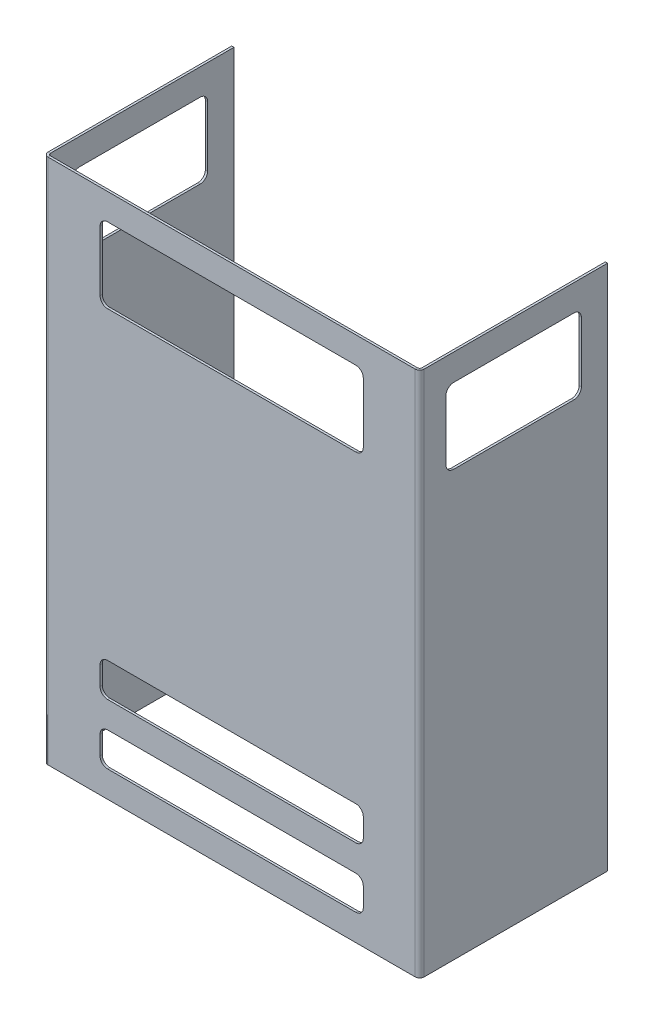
ISO-10303-21;
HEADER;
FILE_DESCRIPTION(('STEP AP214'),'2;1');
FILE_NAME('part.step','',(''),(''),'','','');
FILE_SCHEMA(('AUTOMOTIVE_DESIGN { 1 0 10303 214 1 1 1 1 }'));
ENDSEC;
DATA;
#1=APPLICATION_CONTEXT('core data for automotive mechanical design processes');
#2=APPLICATION_PROTOCOL_DEFINITION('international standard','automotive_design',2000,#1);
#3=PRODUCT_CONTEXT('',#1,'mechanical');
#4=PRODUCT('Part','Part','',(#3));
#5=PRODUCT_RELATED_PRODUCT_CATEGORY('part','',(#4));
#6=PRODUCT_DEFINITION_FORMATION('','',#4);
#7=PRODUCT_DEFINITION_CONTEXT('part definition',#1,'design');
#8=PRODUCT_DEFINITION('design','',#6,#7);
#9=PRODUCT_DEFINITION_SHAPE('','',#8);
#10=(LENGTH_UNIT() NAMED_UNIT(*) SI_UNIT(.MILLI.,.METRE.));
#11=(NAMED_UNIT(*) PLANE_ANGLE_UNIT() SI_UNIT($,.RADIAN.));
#12=(NAMED_UNIT(*) SI_UNIT($,.STERADIAN.) SOLID_ANGLE_UNIT());
#13=UNCERTAINTY_MEASURE_WITH_UNIT(LENGTH_MEASURE(1.E-05),#10,'distance_accuracy_value','');
#14=(GEOMETRIC_REPRESENTATION_CONTEXT(3) GLOBAL_UNCERTAINTY_ASSIGNED_CONTEXT((#13)) GLOBAL_UNIT_ASSIGNED_CONTEXT((#10,
#11,#12)) REPRESENTATION_CONTEXT('',''));
#15=CARTESIAN_POINT('',(0.,0.,0.));
#16=DIRECTION('',(0.,0.,1.));
#17=DIRECTION('',(1.,0.,0.));
#18=AXIS2_PLACEMENT_3D('',#15,#16,#17);
#19=CARTESIAN_POINT('',(-250.,700.,-6.00000000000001));
#20=DIRECTION('',(0.,1.,0.));
#21=DIRECTION('',(0.,0.,1.));
#22=AXIS2_PLACEMENT_3D('',#19,#20,#21);
#23=PLANE('',#22);
#24=DIRECTION('',(1.,0.,0.));
#25=VECTOR('',#24,1.);
#26=CARTESIAN_POINT('',(-250.,700.,-6.00000000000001));
#27=LINE('',#26,#25);
#28=CARTESIAN_POINT('',(-250.,700.,-6.00000000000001));
#29=VERTEX_POINT('',#28);
#30=CARTESIAN_POINT('',(-247.,700.,-6.));
#31=VERTEX_POINT('',#30);
#32=EDGE_CURVE('E11',#29,#31,#27,.T.);
#33=ORIENTED_EDGE('',*,*,#32,.F.);
#34=CARTESIAN_POINT('',(-244.,700.,-6.));
#35=DIRECTION('',(0.,-1.,0.));
#36=DIRECTION('',(0.,0.,-1.));
#37=AXIS2_PLACEMENT_3D('',#34,#35,#36);
#38=CIRCLE('',#37,6.);
#39=CARTESIAN_POINT('',(-244.,700.,0.));
#40=VERTEX_POINT('',#39);
#41=EDGE_CURVE('E703',#29,#40,#38,.F.);
#42=ORIENTED_EDGE('',*,*,#41,.T.);
#43=DIRECTION('',(0.,0.,1.));
#44=VECTOR('',#43,1.);
#45=CARTESIAN_POINT('',(-244.,700.,-3.));
#46=LINE('',#45,#44);
#47=CARTESIAN_POINT('',(-244.,700.,-3.));
#48=VERTEX_POINT('',#47);
#49=EDGE_CURVE('E43',#48,#40,#46,.T.);
#50=ORIENTED_EDGE('',*,*,#49,.F.);
#51=CARTESIAN_POINT('',(-244.,700.,-6.));
#52=DIRECTION('',(0.,1.,0.));
#53=DIRECTION('',(1.,0.,0.));
#54=AXIS2_PLACEMENT_3D('',#51,#52,#53);
#55=CIRCLE('',#54,3.);
#56=EDGE_CURVE('E691',#31,#48,#55,.T.);
#57=ORIENTED_EDGE('',*,*,#56,.F.);
#58=EDGE_LOOP('',(#33,#42,#50,#57));
#59=FACE_BOUND('',#58,.T.);
#60=ADVANCED_FACE('F36',(#59),#23,.T.);
#61=CARTESIAN_POINT('',(-244.,700.,-3.));
#62=DIRECTION('',(0.,1.,0.));
#63=DIRECTION('',(0.,0.,1.));
#64=AXIS2_PLACEMENT_3D('',#61,#62,#63);
#65=PLANE('',#64);
#66=DIRECTION('',(0.,0.,1.));
#67=VECTOR('',#66,1.);
#68=CARTESIAN_POINT('',(-250.,700.,-250.));
#69=LINE('',#68,#67);
#70=CARTESIAN_POINT('',(-250.,700.,-250.));
#71=VERTEX_POINT('',#70);
#72=EDGE_CURVE('E700',#71,#29,#69,.T.);
#73=ORIENTED_EDGE('',*,*,#72,.T.);
#74=ORIENTED_EDGE('',*,*,#32,.T.);
#75=DIRECTION('',(0.,0.,-1.));
#76=VECTOR('',#75,1.);
#77=CARTESIAN_POINT('',(-247.,700.,-250.));
#78=LINE('',#77,#76);
#79=CARTESIAN_POINT('',(-247.,700.,-250.));
#80=VERTEX_POINT('',#79);
#81=EDGE_CURVE('E694',#80,#31,#78,.F.);
#82=ORIENTED_EDGE('',*,*,#81,.F.);
#83=DIRECTION('',(1.,0.,0.));
#84=VECTOR('',#83,1.);
#85=CARTESIAN_POINT('',(-250.,700.,-250.));
#86=LINE('',#85,#84);
#87=EDGE_CURVE('E697',#71,#80,#86,.T.);
#88=ORIENTED_EDGE('',*,*,#87,.F.);
#89=EDGE_LOOP('',(#73,#74,#82,#88));
#90=FACE_BOUND('',#89,.T.);
#91=ADVANCED_FACE('F832',(#90),#65,.T.);
#92=CARTESIAN_POINT('',(-244.,0.,0.));
#93=DIRECTION('',(0.,-1.,0.));
#94=DIRECTION('',(0.,0.,-1.));
#95=AXIS2_PLACEMENT_3D('',#92,#93,#94);
#96=PLANE('',#95);
#97=DIRECTION('',(0.,0.,-1.));
#98=VECTOR('',#97,1.);
#99=CARTESIAN_POINT('',(-244.,0.,0.));
#100=LINE('',#99,#98);
#101=CARTESIAN_POINT('',(-244.,0.,0.));
#102=VERTEX_POINT('',#101);
#103=CARTESIAN_POINT('',(-244.,0.,-3.));
#104=VERTEX_POINT('',#103);
#105=EDGE_CURVE('E788',#102,#104,#100,.T.);
#106=ORIENTED_EDGE('',*,*,#105,.F.);
#107=CARTESIAN_POINT('',(-244.,0.,-6.));
#108=DIRECTION('',(0.,-1.,0.));
#109=DIRECTION('',(0.,0.,-1.));
#110=AXIS2_PLACEMENT_3D('',#107,#108,#109);
#111=CIRCLE('',#110,6.);
#112=CARTESIAN_POINT('',(-250.,0.,-6.00000000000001));
#113=VERTEX_POINT('',#112);
#114=EDGE_CURVE('E739',#113,#102,#111,.F.);
#115=ORIENTED_EDGE('',*,*,#114,.F.);
#116=DIRECTION('',(-1.,0.,0.));
#117=VECTOR('',#116,1.);
#118=CARTESIAN_POINT('',(-247.,0.,-6.));
#119=LINE('',#118,#117);
#120=CARTESIAN_POINT('',(-247.,0.,-6.));
#121=VERTEX_POINT('',#120);
#122=EDGE_CURVE('E786',#121,#113,#119,.T.);
#123=ORIENTED_EDGE('',*,*,#122,.F.);
#124=CARTESIAN_POINT('',(-244.,0.,-6.));
#125=DIRECTION('',(0.,1.,0.));
#126=DIRECTION('',(1.,0.,0.));
#127=AXIS2_PLACEMENT_3D('',#124,#125,#126);
#128=CIRCLE('',#127,3.);
#129=EDGE_CURVE('E727',#121,#104,#128,.T.);
#130=ORIENTED_EDGE('',*,*,#129,.T.);
#131=EDGE_LOOP('',(#106,#115,#123,#130));
#132=FACE_BOUND('',#131,.T.);
#133=ADVANCED_FACE('F840',(#132),#96,.T.);
#134=CARTESIAN_POINT('',(-247.,0.,-6.));
#135=DIRECTION('',(0.,-1.,0.));
#136=DIRECTION('',(0.,0.,-1.));
#137=AXIS2_PLACEMENT_3D('',#134,#135,#136);
#138=PLANE('',#137);
#139=DIRECTION('',(1.,0.,0.));
#140=VECTOR('',#139,1.);
#141=CARTESIAN_POINT('',(-250.,0.,0.));
#142=LINE('',#141,#140);
#143=CARTESIAN_POINT('',(244.,0.,0.));
#144=VERTEX_POINT('',#143);
#145=EDGE_CURVE('E742',#102,#144,#142,.T.);
#146=ORIENTED_EDGE('',*,*,#145,.F.);
#147=ORIENTED_EDGE('',*,*,#105,.T.);
#148=DIRECTION('',(1.,0.,0.));
#149=VECTOR('',#148,1.);
#150=CARTESIAN_POINT('',(-250.,0.,-3.));
#151=LINE('',#150,#149);
#152=CARTESIAN_POINT('',(244.,0.,-3.));
#153=VERTEX_POINT('',#152);
#154=EDGE_CURVE('E724',#104,#153,#151,.T.);
#155=ORIENTED_EDGE('',*,*,#154,.T.);
#156=DIRECTION('',(0.,0.,1.));
#157=VECTOR('',#156,1.);
#158=CARTESIAN_POINT('',(244.,0.,-3.));
#159=LINE('',#158,#157);
#160=EDGE_CURVE('E778',#153,#144,#159,.T.);
#161=ORIENTED_EDGE('',*,*,#160,.T.);
#162=EDGE_LOOP('',(#146,#147,#155,#161));
#163=FACE_BOUND('',#162,.T.);
#164=ADVANCED_FACE('F842',(#163),#138,.T.);
#165=CARTESIAN_POINT('',(244.,700.,0.));
#166=DIRECTION('',(0.,1.,0.));
#167=DIRECTION('',(0.,0.,1.));
#168=AXIS2_PLACEMENT_3D('',#165,#166,#167);
#169=PLANE('',#168);
#170=DIRECTION('',(0.,0.,-1.));
#171=VECTOR('',#170,1.);
#172=CARTESIAN_POINT('',(244.,700.,0.));
#173=LINE('',#172,#171);
#174=CARTESIAN_POINT('',(244.,700.,0.));
#175=VERTEX_POINT('',#174);
#176=CARTESIAN_POINT('',(244.,700.,-3.));
#177=VERTEX_POINT('',#176);
#178=EDGE_CURVE('E784',#175,#177,#173,.T.);
#179=ORIENTED_EDGE('',*,*,#178,.F.);
#180=CARTESIAN_POINT('',(244.,700.,-6.));
#181=DIRECTION('',(0.,-1.,0.));
#182=DIRECTION('',(0.,0.,-1.));
#183=AXIS2_PLACEMENT_3D('',#180,#181,#182);
#184=CIRCLE('',#183,6.);
#185=CARTESIAN_POINT('',(250.,700.,-6.));
#186=VERTEX_POINT('',#185);
#187=EDGE_CURVE('E709',#175,#186,#184,.F.);
#188=ORIENTED_EDGE('',*,*,#187,.T.);
#189=DIRECTION('',(1.,0.,0.));
#190=VECTOR('',#189,1.);
#191=CARTESIAN_POINT('',(247.,700.,-6.));
#192=LINE('',#191,#190);
#193=CARTESIAN_POINT('',(247.,700.,-6.));
#194=VERTEX_POINT('',#193);
#195=EDGE_CURVE('E782',#194,#186,#192,.T.);
#196=ORIENTED_EDGE('',*,*,#195,.F.);
#197=CARTESIAN_POINT('',(244.,700.,-6.));
#198=DIRECTION('',(0.,1.,0.));
#199=DIRECTION('',(1.,0.,0.));
#200=AXIS2_PLACEMENT_3D('',#197,#198,#199);
#201=CIRCLE('',#200,3.);
#202=EDGE_CURVE('E685',#177,#194,#201,.T.);
#203=ORIENTED_EDGE('',*,*,#202,.F.);
#204=EDGE_LOOP('',(#179,#188,#196,#203));
#205=FACE_BOUND('',#204,.T.);
#206=ADVANCED_FACE('F812',(#205),#169,.T.);
#207=CARTESIAN_POINT('',(247.,700.,-6.));
#208=DIRECTION('',(0.,1.,0.));
#209=DIRECTION('',(0.,0.,1.));
#210=AXIS2_PLACEMENT_3D('',#207,#208,#209);
#211=PLANE('',#210);
#212=DIRECTION('',(1.,0.,0.));
#213=VECTOR('',#212,1.);
#214=CARTESIAN_POINT('',(-250.,700.,0.));
#215=LINE('',#214,#213);
#216=EDGE_CURVE('E706',#40,#175,#215,.T.);
#217=ORIENTED_EDGE('',*,*,#216,.T.);
#218=ORIENTED_EDGE('',*,*,#178,.T.);
#219=DIRECTION('',(1.,0.,0.));
#220=VECTOR('',#219,1.);
#221=CARTESIAN_POINT('',(-250.,700.,-3.));
#222=LINE('',#221,#220);
#223=EDGE_CURVE('E688',#48,#177,#222,.T.);
#224=ORIENTED_EDGE('',*,*,#223,.F.);
#225=ORIENTED_EDGE('',*,*,#49,.T.);
#226=EDGE_LOOP('',(#217,#218,#224,#225));
#227=FACE_BOUND('',#226,.T.);
#228=ADVANCED_FACE('F791',(#227),#211,.T.);
#229=CARTESIAN_POINT('',(250.,0.,-6.));
#230=DIRECTION('',(0.,-1.,0.));
#231=DIRECTION('',(0.,0.,-1.));
#232=AXIS2_PLACEMENT_3D('',#229,#230,#231);
#233=PLANE('',#232);
#234=DIRECTION('',(-1.,0.,0.));
#235=VECTOR('',#234,1.);
#236=CARTESIAN_POINT('',(250.,0.,-6.));
#237=LINE('',#236,#235);
#238=CARTESIAN_POINT('',(250.,0.,-6.));
#239=VERTEX_POINT('',#238);
#240=CARTESIAN_POINT('',(247.,0.,-6.));
#241=VERTEX_POINT('',#240);
#242=EDGE_CURVE('E780',#239,#241,#237,.T.);
#243=ORIENTED_EDGE('',*,*,#242,.F.);
#244=CARTESIAN_POINT('',(244.,0.,-6.));
#245=DIRECTION('',(0.,-1.,0.));
#246=DIRECTION('',(0.,0.,-1.));
#247=AXIS2_PLACEMENT_3D('',#244,#245,#246);
#248=CIRCLE('',#247,6.);
#249=EDGE_CURVE('E679',#144,#239,#248,.F.);
#250=ORIENTED_EDGE('',*,*,#249,.F.);
#251=ORIENTED_EDGE('',*,*,#160,.F.);
#252=CARTESIAN_POINT('',(244.,0.,-6.));
#253=DIRECTION('',(0.,1.,0.));
#254=DIRECTION('',(1.,0.,0.));
#255=AXIS2_PLACEMENT_3D('',#252,#253,#254);
#256=CIRCLE('',#255,3.);
#257=EDGE_CURVE('E721',#153,#241,#256,.T.);
#258=ORIENTED_EDGE('',*,*,#257,.T.);
#259=EDGE_LOOP('',(#243,#250,#251,#258));
#260=FACE_BOUND('',#259,.T.);
#261=ADVANCED_FACE('F844',(#260),#233,.T.);
#262=CARTESIAN_POINT('',(244.,0.,-3.));
#263=DIRECTION('',(0.,-1.,0.));
#264=DIRECTION('',(0.,0.,-1.));
#265=AXIS2_PLACEMENT_3D('',#262,#263,#264);
#266=PLANE('',#265);
#267=DIRECTION('',(0.,0.,-1.));
#268=VECTOR('',#267,1.);
#269=CARTESIAN_POINT('',(250.,0.,0.));
#270=LINE('',#269,#268);
#271=CARTESIAN_POINT('',(250.,0.,-250.));
#272=VERTEX_POINT('',#271);
#273=EDGE_CURVE('E535',#239,#272,#270,.T.);
#274=ORIENTED_EDGE('',*,*,#273,.F.);
#275=ORIENTED_EDGE('',*,*,#242,.T.);
#276=DIRECTION('',(0.,0.,-1.));
#277=VECTOR('',#276,1.);
#278=CARTESIAN_POINT('',(247.,0.,0.));
#279=LINE('',#278,#277);
#280=CARTESIAN_POINT('',(247.,0.,-250.));
#281=VERTEX_POINT('',#280);
#282=EDGE_CURVE('E718',#241,#281,#279,.T.);
#283=ORIENTED_EDGE('',*,*,#282,.T.);
#284=DIRECTION('',(1.,0.,0.));
#285=VECTOR('',#284,1.);
#286=CARTESIAN_POINT('',(247.,0.,-250.));
#287=LINE('',#286,#285);
#288=EDGE_CURVE('E715',#281,#272,#287,.T.);
#289=ORIENTED_EDGE('',*,*,#288,.T.);
#290=EDGE_LOOP('',(#274,#275,#283,#289));
#291=FACE_BOUND('',#290,.T.);
#292=ADVANCED_FACE('F850',(#291),#266,.T.);
#293=CARTESIAN_POINT('',(250.,700.,0.));
#294=DIRECTION('',(-1.,0.,0.));
#295=DIRECTION('',(0.,0.,1.));
#296=AXIS2_PLACEMENT_3D('',#293,#294,#295);
#297=PLANE('',#296);
#298=DIRECTION('',(0.,0.,1.));
#299=VECTOR('',#298,1.);
#300=CARTESIAN_POINT('',(250.,665.,-45.));
#301=LINE('',#300,#299);
#302=CARTESIAN_POINT('',(250.,665.,-205.));
#303=VERTEX_POINT('',#302);
#304=CARTESIAN_POINT('',(250.,665.,-45.));
#305=VERTEX_POINT('',#304);
#306=EDGE_CURVE('E412',#303,#305,#301,.T.);
#307=ORIENTED_EDGE('',*,*,#306,.F.);
#308=CARTESIAN_POINT('',(250.,655.,-205.));
#309=DIRECTION('',(1.,0.,0.));
#310=DIRECTION('',(0.,0.,1.));
#311=AXIS2_PLACEMENT_3D('',#308,#309,#310);
#312=CIRCLE('',#311,10.0000000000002);
#313=CARTESIAN_POINT('',(250.,655.,-215.));
#314=VERTEX_POINT('',#313);
#315=EDGE_CURVE('E50',#314,#303,#312,.T.);
#316=ORIENTED_EDGE('',*,*,#315,.F.);
#317=DIRECTION('',(0.,1.,0.));
#318=VECTOR('',#317,1.);
#319=CARTESIAN_POINT('',(250.,655.,-215.));
#320=LINE('',#319,#318);
#321=CARTESIAN_POINT('',(250.,575.,-215.));
#322=VERTEX_POINT('',#321);
#323=EDGE_CURVE('E392',#322,#314,#320,.T.);
#324=ORIENTED_EDGE('',*,*,#323,.F.);
#325=CARTESIAN_POINT('',(250.,575.,-205.));
#326=DIRECTION('',(1.,0.,0.));
#327=DIRECTION('',(0.,0.,-1.));
#328=AXIS2_PLACEMENT_3D('',#325,#326,#327);
#329=CIRCLE('',#328,10.);
#330=CARTESIAN_POINT('',(250.,565.,-205.));
#331=VERTEX_POINT('',#330);
#332=EDGE_CURVE('E395',#331,#322,#329,.T.);
#333=ORIENTED_EDGE('',*,*,#332,.F.);
#334=DIRECTION('',(0.,0.,-1.));
#335=VECTOR('',#334,1.);
#336=CARTESIAN_POINT('',(250.,565.,-45.));
#337=LINE('',#336,#335);
#338=CARTESIAN_POINT('',(250.,565.,-45.));
#339=VERTEX_POINT('',#338);
#340=EDGE_CURVE('E423',#339,#331,#337,.T.);
#341=ORIENTED_EDGE('',*,*,#340,.F.);
#342=CARTESIAN_POINT('',(250.,575.,-45.));
#343=DIRECTION('',(1.,0.,0.));
#344=DIRECTION('',(0.,0.,-1.));
#345=AXIS2_PLACEMENT_3D('',#342,#343,#344);
#346=CIRCLE('',#345,10.);
#347=CARTESIAN_POINT('',(250.,575.,-35.));
#348=VERTEX_POINT('',#347);
#349=EDGE_CURVE('E420',#348,#339,#346,.T.);
#350=ORIENTED_EDGE('',*,*,#349,.F.);
#351=DIRECTION('',(0.,-1.,0.));
#352=VECTOR('',#351,1.);
#353=CARTESIAN_POINT('',(250.,655.,-35.));
#354=LINE('',#353,#352);
#355=CARTESIAN_POINT('',(250.,655.,-34.9999999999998));
#356=VERTEX_POINT('',#355);
#357=EDGE_CURVE('E417',#356,#348,#354,.T.);
#358=ORIENTED_EDGE('',*,*,#357,.F.);
#359=CARTESIAN_POINT('',(250.,655.,-45.));
#360=DIRECTION('',(1.,0.,0.));
#361=DIRECTION('',(0.,0.,-1.));
#362=AXIS2_PLACEMENT_3D('',#359,#360,#361);
#363=CIRCLE('',#362,10.0000000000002);
#364=EDGE_CURVE('E414',#305,#356,#363,.T.);
#365=ORIENTED_EDGE('',*,*,#364,.F.);
#366=EDGE_LOOP('',(#307,#316,#324,#333,#341,#350,#358,#365));
#367=FACE_BOUND('',#366,.T.);
#368=ORIENTED_EDGE('',*,*,#273,.T.);
#369=DIRECTION('',(0.,-1.,0.));
#370=VECTOR('',#369,1.);
#371=CARTESIAN_POINT('',(250.,700.,-250.));
#372=LINE('',#371,#370);
#373=CARTESIAN_POINT('',(250.,700.,-250.));
#374=VERTEX_POINT('',#373);
#375=EDGE_CURVE('E776',#374,#272,#372,.T.);
#376=ORIENTED_EDGE('',*,*,#375,.F.);
#377=DIRECTION('',(0.,0.,-1.));
#378=VECTOR('',#377,1.);
#379=CARTESIAN_POINT('',(250.,700.,0.));
#380=LINE('',#379,#378);
#381=EDGE_CURVE('E676',#186,#374,#380,.T.);
#382=ORIENTED_EDGE('',*,*,#381,.F.);
#383=DIRECTION('',(0.,-1.,0.));
#384=VECTOR('',#383,1.);
#385=CARTESIAN_POINT('',(250.,700.,-6.));
#386=LINE('',#385,#384);
#387=EDGE_CURVE('E712',#186,#239,#386,.T.);
#388=ORIENTED_EDGE('',*,*,#387,.T.);
#389=EDGE_LOOP('',(#368,#376,#382,#388));
#390=FACE_BOUND('',#389,.T.);
#391=ADVANCED_FACE('F847',(#367,#390),#297,.F.);
#392=CARTESIAN_POINT('',(247.,700.,-250.));
#393=DIRECTION('',(0.,0.,-1.));
#394=DIRECTION('',(-1.,0.,0.));
#395=AXIS2_PLACEMENT_3D('',#392,#393,#394);
#396=PLANE('',#395);
#397=ORIENTED_EDGE('',*,*,#288,.F.);
#398=DIRECTION('',(0.,-1.,0.));
#399=VECTOR('',#398,1.);
#400=CARTESIAN_POINT('',(247.,700.,-250.));
#401=LINE('',#400,#399);
#402=CARTESIAN_POINT('',(247.,700.,-250.));
#403=VERTEX_POINT('',#402);
#404=EDGE_CURVE('E774',#403,#281,#401,.T.);
#405=ORIENTED_EDGE('',*,*,#404,.F.);
#406=DIRECTION('',(1.,0.,0.));
#407=VECTOR('',#406,1.);
#408=CARTESIAN_POINT('',(247.,700.,-250.));
#409=LINE('',#408,#407);
#410=EDGE_CURVE('E678',#403,#374,#409,.T.);
#411=ORIENTED_EDGE('',*,*,#410,.T.);
#412=ORIENTED_EDGE('',*,*,#375,.T.);
#413=EDGE_LOOP('',(#397,#405,#411,#412));
#414=FACE_BOUND('',#413,.T.);
#415=ADVANCED_FACE('F854',(#414),#396,.T.);
#416=CARTESIAN_POINT('',(247.,700.,0.));
#417=DIRECTION('',(-1.,0.,0.));
#418=DIRECTION('',(0.,0.,1.));
#419=AXIS2_PLACEMENT_3D('',#416,#417,#418);
#420=PLANE('',#419);
#421=CARTESIAN_POINT('',(247.,655.,-205.));
#422=DIRECTION('',(-1.,0.,0.));
#423=DIRECTION('',(0.,0.,1.));
#424=AXIS2_PLACEMENT_3D('',#421,#422,#423);
#425=CIRCLE('',#424,10.0000000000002);
#426=CARTESIAN_POINT('',(247.,665.,-205.));
#427=VERTEX_POINT('',#426);
#428=CARTESIAN_POINT('',(247.,655.,-215.));
#429=VERTEX_POINT('',#428);
#430=EDGE_CURVE('E481',#427,#429,#425,.T.);
#431=ORIENTED_EDGE('',*,*,#430,.F.);
#432=DIRECTION('',(0.,0.,-1.));
#433=VECTOR('',#432,1.);
#434=CARTESIAN_POINT('',(247.,665.,0.));
#435=LINE('',#434,#433);
#436=CARTESIAN_POINT('',(247.,665.,-45.));
#437=VERTEX_POINT('',#436);
#438=EDGE_CURVE('E454',#437,#427,#435,.T.);
#439=ORIENTED_EDGE('',*,*,#438,.F.);
#440=CARTESIAN_POINT('',(247.,655.,-45.));
#441=DIRECTION('',(-1.,0.,0.));
#442=DIRECTION('',(0.,0.,1.));
#443=AXIS2_PLACEMENT_3D('',#440,#441,#442);
#444=CIRCLE('',#443,10.0000000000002);
#445=CARTESIAN_POINT('',(247.,655.,-34.9999999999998));
#446=VERTEX_POINT('',#445);
#447=EDGE_CURVE('E458',#446,#437,#444,.T.);
#448=ORIENTED_EDGE('',*,*,#447,.F.);
#449=DIRECTION('',(0.,1.,0.));
#450=VECTOR('',#449,1.);
#451=CARTESIAN_POINT('',(247.,700.,-35.));
#452=LINE('',#451,#450);
#453=CARTESIAN_POINT('',(247.,575.,-35.));
#454=VERTEX_POINT('',#453);
#455=EDGE_CURVE('E462',#454,#446,#452,.T.);
#456=ORIENTED_EDGE('',*,*,#455,.F.);
#457=CARTESIAN_POINT('',(247.,575.,-45.));
#458=DIRECTION('',(-1.,0.,0.));
#459=DIRECTION('',(0.,0.,1.));
#460=AXIS2_PLACEMENT_3D('',#457,#458,#459);
#461=CIRCLE('',#460,10.);
#462=CARTESIAN_POINT('',(247.,565.,-45.));
#463=VERTEX_POINT('',#462);
#464=EDGE_CURVE('E466',#463,#454,#461,.T.);
#465=ORIENTED_EDGE('',*,*,#464,.F.);
#466=DIRECTION('',(0.,0.,1.));
#467=VECTOR('',#466,1.);
#468=CARTESIAN_POINT('',(247.,565.,0.));
#469=LINE('',#468,#467);
#470=CARTESIAN_POINT('',(247.,565.,-205.));
#471=VERTEX_POINT('',#470);
#472=EDGE_CURVE('E470',#471,#463,#469,.T.);
#473=ORIENTED_EDGE('',*,*,#472,.F.);
#474=CARTESIAN_POINT('',(247.,575.,-205.));
#475=DIRECTION('',(-1.,0.,0.));
#476=DIRECTION('',(0.,0.,1.));
#477=AXIS2_PLACEMENT_3D('',#474,#475,#476);
#478=CIRCLE('',#477,10.);
#479=CARTESIAN_POINT('',(247.,575.,-215.));
#480=VERTEX_POINT('',#479);
#481=EDGE_CURVE('E474',#480,#471,#478,.T.);
#482=ORIENTED_EDGE('',*,*,#481,.F.);
#483=DIRECTION('',(0.,-1.,0.));
#484=VECTOR('',#483,1.);
#485=CARTESIAN_POINT('',(247.,700.,-215.));
#486=LINE('',#485,#484);
#487=EDGE_CURVE('E478',#429,#480,#486,.T.);
#488=ORIENTED_EDGE('',*,*,#487,.F.);
#489=EDGE_LOOP('',(#431,#439,#448,#456,#465,#473,#482,#488));
#490=FACE_BOUND('',#489,.T.);
#491=ORIENTED_EDGE('',*,*,#282,.F.);
#492=DIRECTION('',(0.,-1.,0.));
#493=VECTOR('',#492,1.);
#494=CARTESIAN_POINT('',(247.,700.,-6.));
#495=LINE('',#494,#493);
#496=EDGE_CURVE('E771',#194,#241,#495,.T.);
#497=ORIENTED_EDGE('',*,*,#496,.F.);
#498=DIRECTION('',(0.,0.,-1.));
#499=VECTOR('',#498,1.);
#500=CARTESIAN_POINT('',(247.,700.,0.));
#501=LINE('',#500,#499);
#502=EDGE_CURVE('E682',#194,#403,#501,.T.);
#503=ORIENTED_EDGE('',*,*,#502,.T.);
#504=ORIENTED_EDGE('',*,*,#404,.T.);
#505=EDGE_LOOP('',(#491,#497,#503,#504));
#506=FACE_BOUND('',#505,.T.);
#507=ADVANCED_FACE('F860',(#490,#506),#420,.T.);
#508=CARTESIAN_POINT('',(244.,700.,-6.));
#509=DIRECTION('',(0.,-1.,0.));
#510=DIRECTION('',(0.,0.,-1.));
#511=AXIS2_PLACEMENT_3D('',#508,#509,#510);
#512=CYLINDRICAL_SURFACE('',#511,3.);
#513=ORIENTED_EDGE('',*,*,#257,.F.);
#514=DIRECTION('',(0.,-1.,0.));
#515=VECTOR('',#514,1.);
#516=CARTESIAN_POINT('',(244.,700.,-3.));
#517=LINE('',#516,#515);
#518=EDGE_CURVE('E768',#177,#153,#517,.T.);
#519=ORIENTED_EDGE('',*,*,#518,.F.);
#520=ORIENTED_EDGE('',*,*,#202,.T.);
#521=ORIENTED_EDGE('',*,*,#496,.T.);
#522=EDGE_LOOP('',(#513,#519,#520,#521));
#523=FACE_BOUND('',#522,.T.);
#524=ADVANCED_FACE('F818',(#523),#512,.F.);
#525=CARTESIAN_POINT('',(-250.,700.,-3.));
#526=DIRECTION('',(0.,0.,-1.));
#527=DIRECTION('',(-1.,0.,0.));
#528=AXIS2_PLACEMENT_3D('',#525,#526,#527);
#529=PLANE('',#528);
#530=CARTESIAN_POINT('',(165.,655.,-3.));
#531=DIRECTION('',(0.,0.,1.));
#532=DIRECTION('',(-1.,0.,0.));
#533=AXIS2_PLACEMENT_3D('',#530,#531,#532);
#534=CIRCLE('',#533,10.0000000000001);
#535=CARTESIAN_POINT('',(175.,655.,-3.));
#536=VERTEX_POINT('',#535);
#537=CARTESIAN_POINT('',(165.,665.,-3.));
#538=VERTEX_POINT('',#537);
#539=EDGE_CURVE('E484',#536,#538,#534,.T.);
#540=ORIENTED_EDGE('',*,*,#539,.T.);
#541=DIRECTION('',(-1.,0.,0.));
#542=VECTOR('',#541,1.);
#543=CARTESIAN_POINT('',(-165.,665.,-3.));
#544=LINE('',#543,#542);
#545=CARTESIAN_POINT('',(-165.,665.,-3.));
#546=VERTEX_POINT('',#545);
#547=EDGE_CURVE('E487',#538,#546,#544,.T.);
#548=ORIENTED_EDGE('',*,*,#547,.T.);
#549=CARTESIAN_POINT('',(-165.,655.,-3.));
#550=DIRECTION('',(0.,0.,1.));
#551=DIRECTION('',(1.,0.,0.));
#552=AXIS2_PLACEMENT_3D('',#549,#550,#551);
#553=CIRCLE('',#552,10.0000000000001);
#554=CARTESIAN_POINT('',(-175.,655.,-3.));
#555=VERTEX_POINT('',#554);
#556=EDGE_CURVE('E491',#546,#555,#553,.T.);
#557=ORIENTED_EDGE('',*,*,#556,.T.);
#558=DIRECTION('',(0.,-1.,0.));
#559=VECTOR('',#558,1.);
#560=CARTESIAN_POINT('',(-175.,655.,-3.));
#561=LINE('',#560,#559);
#562=CARTESIAN_POINT('',(-175.,575.,-3.));
#563=VERTEX_POINT('',#562);
#564=EDGE_CURVE('E494',#555,#563,#561,.T.);
#565=ORIENTED_EDGE('',*,*,#564,.T.);
#566=CARTESIAN_POINT('',(-165.,575.,-3.));
#567=DIRECTION('',(0.,0.,1.));
#568=DIRECTION('',(1.,0.,0.));
#569=AXIS2_PLACEMENT_3D('',#566,#567,#568);
#570=CIRCLE('',#569,10.);
#571=CARTESIAN_POINT('',(-165.,565.,-3.));
#572=VERTEX_POINT('',#571);
#573=EDGE_CURVE('E497',#563,#572,#570,.T.);
#574=ORIENTED_EDGE('',*,*,#573,.T.);
#575=DIRECTION('',(1.,0.,0.));
#576=VECTOR('',#575,1.);
#577=CARTESIAN_POINT('',(-165.,565.,-3.));
#578=LINE('',#577,#576);
#579=CARTESIAN_POINT('',(165.,565.,-3.));
#580=VERTEX_POINT('',#579);
#581=EDGE_CURVE('E500',#572,#580,#578,.T.);
#582=ORIENTED_EDGE('',*,*,#581,.T.);
#583=CARTESIAN_POINT('',(165.,575.,-3.));
#584=DIRECTION('',(0.,0.,1.));
#585=DIRECTION('',(1.,0.,0.));
#586=AXIS2_PLACEMENT_3D('',#583,#584,#585);
#587=CIRCLE('',#586,10.);
#588=CARTESIAN_POINT('',(175.,575.,-3.));
#589=VERTEX_POINT('',#588);
#590=EDGE_CURVE('E503',#580,#589,#587,.T.);
#591=ORIENTED_EDGE('',*,*,#590,.T.);
#592=DIRECTION('',(0.,1.,0.));
#593=VECTOR('',#592,1.);
#594=CARTESIAN_POINT('',(175.,655.,-3.));
#595=LINE('',#594,#593);
#596=EDGE_CURVE('E506',#589,#536,#595,.T.);
#597=ORIENTED_EDGE('',*,*,#596,.T.);
#598=EDGE_LOOP('',(#540,#548,#557,#565,#574,#582,#591,#597));
#599=FACE_BOUND('',#598,.T.);
#600=CARTESIAN_POINT('',(-165.,45.,-3.));
#601=DIRECTION('',(0.,0.,1.));
#602=DIRECTION('',(1.,0.,0.));
#603=AXIS2_PLACEMENT_3D('',#600,#601,#602);
#604=CIRCLE('',#603,10.);
#605=CARTESIAN_POINT('',(-175.,45.,-3.));
#606=VERTEX_POINT('',#605);
#607=CARTESIAN_POINT('',(-165.,35.,-3.));
#608=VERTEX_POINT('',#607);
#609=EDGE_CURVE('E550',#606,#608,#604,.T.);
#610=ORIENTED_EDGE('',*,*,#609,.T.);
#611=DIRECTION('',(1.,0.,0.));
#612=VECTOR('',#611,1.);
#613=CARTESIAN_POINT('',(-165.,35.,-3.));
#614=LINE('',#613,#612);
#615=CARTESIAN_POINT('',(165.,35.,-3.));
#616=VERTEX_POINT('',#615);
#617=EDGE_CURVE('E553',#608,#616,#614,.T.);
#618=ORIENTED_EDGE('',*,*,#617,.T.);
#619=CARTESIAN_POINT('',(165.,45.,-3.));
#620=DIRECTION('',(0.,0.,1.));
#621=DIRECTION('',(1.,0.,0.));
#622=AXIS2_PLACEMENT_3D('',#619,#620,#621);
#623=CIRCLE('',#622,10.);
#624=CARTESIAN_POINT('',(175.,45.,-3.));
#625=VERTEX_POINT('',#624);
#626=EDGE_CURVE('E557',#616,#625,#623,.T.);
#627=ORIENTED_EDGE('',*,*,#626,.T.);
#628=DIRECTION('',(0.,1.,0.));
#629=VECTOR('',#628,1.);
#630=CARTESIAN_POINT('',(175.,70.,-3.));
#631=LINE('',#630,#629);
#632=CARTESIAN_POINT('',(175.,70.,-3.));
#633=VERTEX_POINT('',#632);
#634=EDGE_CURVE('E560',#625,#633,#631,.T.);
#635=ORIENTED_EDGE('',*,*,#634,.T.);
#636=CARTESIAN_POINT('',(165.,70.,-3.));
#637=DIRECTION('',(0.,0.,1.));
#638=DIRECTION('',(-1.,0.,0.));
#639=AXIS2_PLACEMENT_3D('',#636,#637,#638);
#640=CIRCLE('',#639,10.);
#641=CARTESIAN_POINT('',(165.,80.,-3.));
#642=VERTEX_POINT('',#641);
#643=EDGE_CURVE('E563',#633,#642,#640,.T.);
#644=ORIENTED_EDGE('',*,*,#643,.T.);
#645=DIRECTION('',(-1.,0.,0.));
#646=VECTOR('',#645,1.);
#647=CARTESIAN_POINT('',(-165.,80.,-3.));
#648=LINE('',#647,#646);
#649=CARTESIAN_POINT('',(-165.,80.,-3.));
#650=VERTEX_POINT('',#649);
#651=EDGE_CURVE('E566',#642,#650,#648,.T.);
#652=ORIENTED_EDGE('',*,*,#651,.T.);
#653=CARTESIAN_POINT('',(-165.,70.,-3.));
#654=DIRECTION('',(0.,0.,1.));
#655=DIRECTION('',(1.,0.,0.));
#656=AXIS2_PLACEMENT_3D('',#653,#654,#655);
#657=CIRCLE('',#656,10.);
#658=CARTESIAN_POINT('',(-175.,70.,-3.));
#659=VERTEX_POINT('',#658);
#660=EDGE_CURVE('E569',#650,#659,#657,.T.);
#661=ORIENTED_EDGE('',*,*,#660,.T.);
#662=DIRECTION('',(0.,-1.,0.));
#663=VECTOR('',#662,1.);
#664=CARTESIAN_POINT('',(-175.,70.,-3.));
#665=LINE('',#664,#663);
#666=EDGE_CURVE('E572',#659,#606,#665,.T.);
#667=ORIENTED_EDGE('',*,*,#666,.T.);
#668=EDGE_LOOP('',(#610,#618,#627,#635,#644,#652,#661,#667));
#669=FACE_BOUND('',#668,.T.);
#670=CARTESIAN_POINT('',(-165.,125.,-3.));
#671=DIRECTION('',(0.,0.,1.));
#672=DIRECTION('',(1.,0.,0.));
#673=AXIS2_PLACEMENT_3D('',#670,#671,#672);
#674=CIRCLE('',#673,10.);
#675=CARTESIAN_POINT('',(-175.,125.,-3.));
#676=VERTEX_POINT('',#675);
#677=CARTESIAN_POINT('',(-165.,115.,-3.));
#678=VERTEX_POINT('',#677);
#679=EDGE_CURVE('E614',#676,#678,#674,.T.);
#680=ORIENTED_EDGE('',*,*,#679,.T.);
#681=DIRECTION('',(1.,0.,0.));
#682=VECTOR('',#681,1.);
#683=CARTESIAN_POINT('',(-165.,115.,-3.));
#684=LINE('',#683,#682);
#685=CARTESIAN_POINT('',(165.,115.,-3.));
#686=VERTEX_POINT('',#685);
#687=EDGE_CURVE('E617',#678,#686,#684,.T.);
#688=ORIENTED_EDGE('',*,*,#687,.T.);
#689=CARTESIAN_POINT('',(165.,125.,-3.));
#690=DIRECTION('',(0.,0.,1.));
#691=DIRECTION('',(1.,0.,0.));
#692=AXIS2_PLACEMENT_3D('',#689,#690,#691);
#693=CIRCLE('',#692,10.);
#694=CARTESIAN_POINT('',(175.,125.,-3.));
#695=VERTEX_POINT('',#694);
#696=EDGE_CURVE('E621',#686,#695,#693,.T.);
#697=ORIENTED_EDGE('',*,*,#696,.T.);
#698=DIRECTION('',(0.,1.,0.));
#699=VECTOR('',#698,1.);
#700=CARTESIAN_POINT('',(175.,150.,-3.));
#701=LINE('',#700,#699);
#702=CARTESIAN_POINT('',(175.,150.,-3.));
#703=VERTEX_POINT('',#702);
#704=EDGE_CURVE('E624',#695,#703,#701,.T.);
#705=ORIENTED_EDGE('',*,*,#704,.T.);
#706=CARTESIAN_POINT('',(165.,150.,-3.));
#707=DIRECTION('',(0.,0.,1.));
#708=DIRECTION('',(-1.,0.,0.));
#709=AXIS2_PLACEMENT_3D('',#706,#707,#708);
#710=CIRCLE('',#709,10.);
#711=CARTESIAN_POINT('',(165.,160.,-3.));
#712=VERTEX_POINT('',#711);
#713=EDGE_CURVE('E627',#703,#712,#710,.T.);
#714=ORIENTED_EDGE('',*,*,#713,.T.);
#715=DIRECTION('',(-1.,0.,0.));
#716=VECTOR('',#715,1.);
#717=CARTESIAN_POINT('',(-165.,160.,-3.));
#718=LINE('',#717,#716);
#719=CARTESIAN_POINT('',(-165.,160.,-3.));
#720=VERTEX_POINT('',#719);
#721=EDGE_CURVE('E630',#712,#720,#718,.T.);
#722=ORIENTED_EDGE('',*,*,#721,.T.);
#723=CARTESIAN_POINT('',(-165.,150.,-3.));
#724=DIRECTION('',(0.,0.,1.));
#725=DIRECTION('',(1.,0.,0.));
#726=AXIS2_PLACEMENT_3D('',#723,#724,#725);
#727=CIRCLE('',#726,10.);
#728=CARTESIAN_POINT('',(-175.,150.,-3.));
#729=VERTEX_POINT('',#728);
#730=EDGE_CURVE('E633',#720,#729,#727,.T.);
#731=ORIENTED_EDGE('',*,*,#730,.T.);
#732=DIRECTION('',(0.,-1.,0.));
#733=VECTOR('',#732,1.);
#734=CARTESIAN_POINT('',(-175.,150.,-3.));
#735=LINE('',#734,#733);
#736=EDGE_CURVE('E636',#729,#676,#735,.T.);
#737=ORIENTED_EDGE('',*,*,#736,.T.);
#738=EDGE_LOOP('',(#680,#688,#697,#705,#714,#722,#731,#737));
#739=FACE_BOUND('',#738,.T.);
#740=ORIENTED_EDGE('',*,*,#154,.F.);
#741=DIRECTION('',(0.,-1.,0.));
#742=VECTOR('',#741,1.);
#743=CARTESIAN_POINT('',(-244.,700.,-3.));
#744=LINE('',#743,#742);
#745=EDGE_CURVE('E765',#48,#104,#744,.T.);
#746=ORIENTED_EDGE('',*,*,#745,.F.);
#747=ORIENTED_EDGE('',*,*,#223,.T.);
#748=ORIENTED_EDGE('',*,*,#518,.T.);
#749=EDGE_LOOP('',(#740,#746,#747,#748));
#750=FACE_BOUND('',#749,.T.);
#751=ADVANCED_FACE('F821',(#599,#669,#739,#750),#529,.T.);
#752=CARTESIAN_POINT('',(-244.,700.,-6.));
#753=DIRECTION('',(0.,-1.,0.));
#754=DIRECTION('',(0.,0.,-1.));
#755=AXIS2_PLACEMENT_3D('',#752,#753,#754);
#756=CYLINDRICAL_SURFACE('',#755,3.);
#757=ORIENTED_EDGE('',*,*,#129,.F.);
#758=DIRECTION('',(0.,-1.,0.));
#759=VECTOR('',#758,1.);
#760=CARTESIAN_POINT('',(-247.,700.,-6.));
#761=LINE('',#760,#759);
#762=EDGE_CURVE('E762',#31,#121,#761,.T.);
#763=ORIENTED_EDGE('',*,*,#762,.F.);
#764=ORIENTED_EDGE('',*,*,#56,.T.);
#765=ORIENTED_EDGE('',*,*,#745,.T.);
#766=EDGE_LOOP('',(#757,#763,#764,#765));
#767=FACE_BOUND('',#766,.T.);
#768=ADVANCED_FACE('F824',(#767),#756,.F.);
#769=CARTESIAN_POINT('',(-247.,700.,-250.));
#770=DIRECTION('',(1.,0.,0.));
#771=DIRECTION('',(0.,0.,-1.));
#772=AXIS2_PLACEMENT_3D('',#769,#770,#771);
#773=PLANE('',#772);
#774=CARTESIAN_POINT('',(-247.,655.,-205.));
#775=DIRECTION('',(1.,0.,0.));
#776=DIRECTION('',(0.,0.,-1.));
#777=AXIS2_PLACEMENT_3D('',#774,#775,#776);
#778=CIRCLE('',#777,10.0000000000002);
#779=CARTESIAN_POINT('',(-247.,655.,-215.));
#780=VERTEX_POINT('',#779);
#781=CARTESIAN_POINT('',(-247.,665.,-205.));
#782=VERTEX_POINT('',#781);
#783=EDGE_CURVE('E372',#780,#782,#778,.T.);
#784=ORIENTED_EDGE('',*,*,#783,.F.);
#785=DIRECTION('',(0.,1.,0.));
#786=VECTOR('',#785,1.);
#787=CARTESIAN_POINT('',(-247.,700.,-215.));
#788=LINE('',#787,#786);
#789=CARTESIAN_POINT('',(-247.,575.,-215.));
#790=VERTEX_POINT('',#789);
#791=EDGE_CURVE('E476',#790,#780,#788,.T.);
#792=ORIENTED_EDGE('',*,*,#791,.F.);
#793=CARTESIAN_POINT('',(-247.,575.,-205.));
#794=DIRECTION('',(1.,0.,0.));
#795=DIRECTION('',(0.,0.,-1.));
#796=AXIS2_PLACEMENT_3D('',#793,#794,#795);
#797=CIRCLE('',#796,10.);
#798=CARTESIAN_POINT('',(-247.,565.,-205.));
#799=VERTEX_POINT('',#798);
#800=EDGE_CURVE('E472',#799,#790,#797,.T.);
#801=ORIENTED_EDGE('',*,*,#800,.F.);
#802=DIRECTION('',(0.,0.,-1.));
#803=VECTOR('',#802,1.);
#804=CARTESIAN_POINT('',(-247.,565.,-250.));
#805=LINE('',#804,#803);
#806=CARTESIAN_POINT('',(-247.,565.,-45.));
#807=VERTEX_POINT('',#806);
#808=EDGE_CURVE('E468',#807,#799,#805,.T.);
#809=ORIENTED_EDGE('',*,*,#808,.F.);
#810=CARTESIAN_POINT('',(-247.,575.,-45.));
#811=DIRECTION('',(1.,0.,0.));
#812=DIRECTION('',(0.,0.,-1.));
#813=AXIS2_PLACEMENT_3D('',#810,#811,#812);
#814=CIRCLE('',#813,10.);
#815=CARTESIAN_POINT('',(-247.,575.,-35.));
#816=VERTEX_POINT('',#815);
#817=EDGE_CURVE('E464',#816,#807,#814,.T.);
#818=ORIENTED_EDGE('',*,*,#817,.F.);
#819=DIRECTION('',(0.,-1.,0.));
#820=VECTOR('',#819,1.);
#821=CARTESIAN_POINT('',(-247.,700.,-35.));
#822=LINE('',#821,#820);
#823=CARTESIAN_POINT('',(-247.,655.,-34.9999999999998));
#824=VERTEX_POINT('',#823);
#825=EDGE_CURVE('E460',#824,#816,#822,.T.);
#826=ORIENTED_EDGE('',*,*,#825,.F.);
#827=CARTESIAN_POINT('',(-247.,655.,-45.));
#828=DIRECTION('',(1.,0.,0.));
#829=DIRECTION('',(0.,0.,-1.));
#830=AXIS2_PLACEMENT_3D('',#827,#828,#829);
#831=CIRCLE('',#830,10.0000000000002);
#832=CARTESIAN_POINT('',(-247.,665.,-45.));
#833=VERTEX_POINT('',#832);
#834=EDGE_CURVE('E456',#833,#824,#831,.T.);
#835=ORIENTED_EDGE('',*,*,#834,.F.);
#836=DIRECTION('',(0.,0.,1.));
#837=VECTOR('',#836,1.);
#838=CARTESIAN_POINT('',(-247.,665.,-250.));
#839=LINE('',#838,#837);
#840=EDGE_CURVE('E430',#782,#833,#839,.T.);
#841=ORIENTED_EDGE('',*,*,#840,.F.);
#842=EDGE_LOOP('',(#784,#792,#801,#809,#818,#826,#835,#841));
#843=FACE_BOUND('',#842,.T.);
#844=DIRECTION('',(0.,0.,-1.));
#845=VECTOR('',#844,1.);
#846=CARTESIAN_POINT('',(-247.,0.,-250.));
#847=LINE('',#846,#845);
#848=CARTESIAN_POINT('',(-247.,0.,-250.));
#849=VERTEX_POINT('',#848);
#850=EDGE_CURVE('E730',#849,#121,#847,.F.);
#851=ORIENTED_EDGE('',*,*,#850,.F.);
#852=DIRECTION('',(0.,-1.,0.));
#853=VECTOR('',#852,1.);
#854=CARTESIAN_POINT('',(-247.,700.,-250.));
#855=LINE('',#854,#853);
#856=EDGE_CURVE('E760',#80,#849,#855,.T.);
#857=ORIENTED_EDGE('',*,*,#856,.F.);
#858=ORIENTED_EDGE('',*,*,#81,.T.);
#859=ORIENTED_EDGE('',*,*,#762,.T.);
#860=EDGE_LOOP('',(#851,#857,#858,#859));
#861=FACE_BOUND('',#860,.T.);
#862=ADVANCED_FACE('F829',(#843,#861),#773,.T.);
#863=CARTESIAN_POINT('',(-250.,700.,-250.));
#864=DIRECTION('',(0.,0.,-1.));
#865=DIRECTION('',(-1.,0.,0.));
#866=AXIS2_PLACEMENT_3D('',#863,#864,#865);
#867=PLANE('',#866);
#868=DIRECTION('',(1.,0.,0.));
#869=VECTOR('',#868,1.);
#870=CARTESIAN_POINT('',(-250.,0.,-250.));
#871=LINE('',#870,#869);
#872=CARTESIAN_POINT('',(-250.,0.,-250.));
#873=VERTEX_POINT('',#872);
#874=EDGE_CURVE('E733',#873,#849,#871,.T.);
#875=ORIENTED_EDGE('',*,*,#874,.F.);
#876=DIRECTION('',(0.,-1.,0.));
#877=VECTOR('',#876,1.);
#878=CARTESIAN_POINT('',(-250.,700.,-250.));
#879=LINE('',#878,#877);
#880=EDGE_CURVE('E758',#71,#873,#879,.T.);
#881=ORIENTED_EDGE('',*,*,#880,.F.);
#882=ORIENTED_EDGE('',*,*,#87,.T.);
#883=ORIENTED_EDGE('',*,*,#856,.T.);
#884=EDGE_LOOP('',(#875,#881,#882,#883));
#885=FACE_BOUND('',#884,.T.);
#886=ADVANCED_FACE('F835',(#885),#867,.T.);
#887=CARTESIAN_POINT('',(-250.,700.,-250.));
#888=DIRECTION('',(1.,0.,0.));
#889=DIRECTION('',(0.,0.,-1.));
#890=AXIS2_PLACEMENT_3D('',#887,#888,#889);
#891=PLANE('',#890);
#892=DIRECTION('',(0.,1.,0.));
#893=VECTOR('',#892,1.);
#894=CARTESIAN_POINT('',(-250.,655.,-215.));
#895=LINE('',#894,#893);
#896=CARTESIAN_POINT('',(-250.,575.,-215.));
#897=VERTEX_POINT('',#896);
#898=CARTESIAN_POINT('',(-250.,655.,-215.));
#899=VERTEX_POINT('',#898);
#900=EDGE_CURVE('E391',#897,#899,#895,.T.);
#901=ORIENTED_EDGE('',*,*,#900,.T.);
#902=CARTESIAN_POINT('',(-250.,655.,-205.));
#903=DIRECTION('',(1.,0.,0.));
#904=DIRECTION('',(0.,0.,1.));
#905=AXIS2_PLACEMENT_3D('',#902,#903,#904);
#906=CIRCLE('',#905,10.0000000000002);
#907=CARTESIAN_POINT('',(-250.,665.,-205.));
#908=VERTEX_POINT('',#907);
#909=EDGE_CURVE('E369',#899,#908,#906,.T.);
#910=ORIENTED_EDGE('',*,*,#909,.T.);
#911=DIRECTION('',(0.,0.,1.));
#912=VECTOR('',#911,1.);
#913=CARTESIAN_POINT('',(-250.,665.,-45.));
#914=LINE('',#913,#912);
#915=CARTESIAN_POINT('',(-250.,665.,-45.));
#916=VERTEX_POINT('',#915);
#917=EDGE_CURVE('E379',#908,#916,#914,.T.);
#918=ORIENTED_EDGE('',*,*,#917,.T.);
#919=CARTESIAN_POINT('',(-250.,655.,-45.));
#920=DIRECTION('',(1.,0.,0.));
#921=DIRECTION('',(0.,0.,-1.));
#922=AXIS2_PLACEMENT_3D('',#919,#920,#921);
#923=CIRCLE('',#922,10.0000000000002);
#924=CARTESIAN_POINT('',(-250.,655.,-34.9999999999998));
#925=VERTEX_POINT('',#924);
#926=EDGE_CURVE('E385',#916,#925,#923,.T.);
#927=ORIENTED_EDGE('',*,*,#926,.T.);
#928=DIRECTION('',(0.,-1.,0.));
#929=VECTOR('',#928,1.);
#930=CARTESIAN_POINT('',(-250.,655.,-35.));
#931=LINE('',#930,#929);
#932=CARTESIAN_POINT('',(-250.,575.,-35.));
#933=VERTEX_POINT('',#932);
#934=EDGE_CURVE('E399',#925,#933,#931,.T.);
#935=ORIENTED_EDGE('',*,*,#934,.T.);
#936=CARTESIAN_POINT('',(-250.,575.,-45.));
#937=DIRECTION('',(1.,0.,0.));
#938=DIRECTION('',(0.,0.,-1.));
#939=AXIS2_PLACEMENT_3D('',#936,#937,#938);
#940=CIRCLE('',#939,10.);
#941=CARTESIAN_POINT('',(-250.,565.,-45.));
#942=VERTEX_POINT('',#941);
#943=EDGE_CURVE('E402',#933,#942,#940,.T.);
#944=ORIENTED_EDGE('',*,*,#943,.T.);
#945=DIRECTION('',(0.,0.,-1.));
#946=VECTOR('',#945,1.);
#947=CARTESIAN_POINT('',(-250.,565.,-45.));
#948=LINE('',#947,#946);
#949=CARTESIAN_POINT('',(-250.,565.,-205.));
#950=VERTEX_POINT('',#949);
#951=EDGE_CURVE('E405',#942,#950,#948,.T.);
#952=ORIENTED_EDGE('',*,*,#951,.T.);
#953=CARTESIAN_POINT('',(-250.,575.,-205.));
#954=DIRECTION('',(1.,0.,0.));
#955=DIRECTION('',(0.,0.,-1.));
#956=AXIS2_PLACEMENT_3D('',#953,#954,#955);
#957=CIRCLE('',#956,10.);
#958=EDGE_CURVE('E408',#950,#897,#957,.T.);
#959=ORIENTED_EDGE('',*,*,#958,.T.);
#960=EDGE_LOOP('',(#901,#910,#918,#927,#935,#944,#952,#959));
#961=FACE_BOUND('',#960,.T.);
#962=DIRECTION('',(0.,0.,1.));
#963=VECTOR('',#962,1.);
#964=CARTESIAN_POINT('',(-250.,0.,-250.));
#965=LINE('',#964,#963);
#966=EDGE_CURVE('E736',#873,#113,#965,.T.);
#967=ORIENTED_EDGE('',*,*,#966,.T.);
#968=DIRECTION('',(0.,-1.,0.));
#969=VECTOR('',#968,1.);
#970=CARTESIAN_POINT('',(-250.,700.,-6.00000000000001));
#971=LINE('',#970,#969);
#972=EDGE_CURVE('E755',#29,#113,#971,.T.);
#973=ORIENTED_EDGE('',*,*,#972,.F.);
#974=ORIENTED_EDGE('',*,*,#72,.F.);
#975=ORIENTED_EDGE('',*,*,#880,.T.);
#976=EDGE_LOOP('',(#967,#973,#974,#975));
#977=FACE_BOUND('',#976,.T.);
#978=ADVANCED_FACE('F387',(#961,#977),#891,.F.);
#979=CARTESIAN_POINT('',(-244.,700.,-6.));
#980=DIRECTION('',(0.,-1.,0.));
#981=DIRECTION('',(0.,0.,-1.));
#982=AXIS2_PLACEMENT_3D('',#979,#980,#981);
#983=CYLINDRICAL_SURFACE('',#982,6.);
#984=ORIENTED_EDGE('',*,*,#114,.T.);
#985=DIRECTION('',(0.,-1.,0.));
#986=VECTOR('',#985,1.);
#987=CARTESIAN_POINT('',(-244.,700.,0.));
#988=LINE('',#987,#986);
#989=EDGE_CURVE('E752',#40,#102,#988,.T.);
#990=ORIENTED_EDGE('',*,*,#989,.F.);
#991=ORIENTED_EDGE('',*,*,#41,.F.);
#992=ORIENTED_EDGE('',*,*,#972,.T.);
#993=EDGE_LOOP('',(#984,#990,#991,#992));
#994=FACE_BOUND('',#993,.T.);
#995=ADVANCED_FACE('F800',(#994),#983,.T.);
#996=CARTESIAN_POINT('',(-250.,700.,0.));
#997=DIRECTION('',(0.,0.,-1.));
#998=DIRECTION('',(-1.,0.,0.));
#999=AXIS2_PLACEMENT_3D('',#996,#997,#998);
#1000=PLANE('',#999);
#1001=DIRECTION('',(-1.,0.,0.));
#1002=VECTOR('',#1001,1.);
#1003=CARTESIAN_POINT('',(-165.,665.,0.));
#1004=LINE('',#1003,#1002);
#1005=CARTESIAN_POINT('',(165.,665.,0.));
#1006=VERTEX_POINT('',#1005);
#1007=CARTESIAN_POINT('',(-165.,665.,0.));
#1008=VERTEX_POINT('',#1007);
#1009=EDGE_CURVE('E512',#1006,#1008,#1004,.T.);
#1010=ORIENTED_EDGE('',*,*,#1009,.F.);
#1011=CARTESIAN_POINT('',(165.,655.,0.));
#1012=DIRECTION('',(0.,0.,1.));
#1013=DIRECTION('',(-1.,0.,0.));
#1014=AXIS2_PLACEMENT_3D('',#1011,#1012,#1013);
#1015=CIRCLE('',#1014,10.0000000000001);
#1016=CARTESIAN_POINT('',(175.,655.,0.));
#1017=VERTEX_POINT('',#1016);
#1018=EDGE_CURVE('E510',#1017,#1006,#1015,.T.);
#1019=ORIENTED_EDGE('',*,*,#1018,.F.);
#1020=DIRECTION('',(0.,1.,0.));
#1021=VECTOR('',#1020,1.);
#1022=CARTESIAN_POINT('',(175.,655.,0.));
#1023=LINE('',#1022,#1021);
#1024=CARTESIAN_POINT('',(175.,575.,0.));
#1025=VERTEX_POINT('',#1024);
#1026=EDGE_CURVE('E488',#1025,#1017,#1023,.T.);
#1027=ORIENTED_EDGE('',*,*,#1026,.F.);
#1028=CARTESIAN_POINT('',(165.,575.,0.));
#1029=DIRECTION('',(0.,0.,1.));
#1030=DIRECTION('',(1.,0.,0.));
#1031=AXIS2_PLACEMENT_3D('',#1028,#1029,#1030);
#1032=CIRCLE('',#1031,10.);
#1033=CARTESIAN_POINT('',(165.,565.,0.));
#1034=VERTEX_POINT('',#1033);
#1035=EDGE_CURVE('E528',#1034,#1025,#1032,.T.);
#1036=ORIENTED_EDGE('',*,*,#1035,.F.);
#1037=DIRECTION('',(1.,0.,0.));
#1038=VECTOR('',#1037,1.);
#1039=CARTESIAN_POINT('',(-165.,565.,0.));
#1040=LINE('',#1039,#1038);
#1041=CARTESIAN_POINT('',(-165.,565.,0.));
#1042=VERTEX_POINT('',#1041);
#1043=EDGE_CURVE('E525',#1042,#1034,#1040,.T.);
#1044=ORIENTED_EDGE('',*,*,#1043,.F.);
#1045=CARTESIAN_POINT('',(-165.,575.,0.));
#1046=DIRECTION('',(0.,0.,1.));
#1047=DIRECTION('',(1.,0.,0.));
#1048=AXIS2_PLACEMENT_3D('',#1045,#1046,#1047);
#1049=CIRCLE('',#1048,10.);
#1050=CARTESIAN_POINT('',(-175.,575.,0.));
#1051=VERTEX_POINT('',#1050);
#1052=EDGE_CURVE('E522',#1051,#1042,#1049,.T.);
#1053=ORIENTED_EDGE('',*,*,#1052,.F.);
#1054=DIRECTION('',(0.,-1.,0.));
#1055=VECTOR('',#1054,1.);
#1056=CARTESIAN_POINT('',(-175.,655.,0.));
#1057=LINE('',#1056,#1055);
#1058=CARTESIAN_POINT('',(-175.,655.,0.));
#1059=VERTEX_POINT('',#1058);
#1060=EDGE_CURVE('E519',#1059,#1051,#1057,.T.);
#1061=ORIENTED_EDGE('',*,*,#1060,.F.);
#1062=CARTESIAN_POINT('',(-165.,655.,0.));
#1063=DIRECTION('',(0.,0.,1.));
#1064=DIRECTION('',(1.,0.,0.));
#1065=AXIS2_PLACEMENT_3D('',#1062,#1063,#1064);
#1066=CIRCLE('',#1065,10.0000000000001);
#1067=EDGE_CURVE('E516',#1008,#1059,#1066,.T.);
#1068=ORIENTED_EDGE('',*,*,#1067,.F.);
#1069=EDGE_LOOP('',(#1010,#1019,#1027,#1036,#1044,#1053,#1061,#1068));
#1070=FACE_BOUND('',#1069,.T.);
#1071=DIRECTION('',(1.,0.,0.));
#1072=VECTOR('',#1071,1.);
#1073=CARTESIAN_POINT('',(-165.,35.,0.));
#1074=LINE('',#1073,#1072);
#1075=CARTESIAN_POINT('',(-165.,35.,0.));
#1076=VERTEX_POINT('',#1075);
#1077=CARTESIAN_POINT('',(165.,35.,0.));
#1078=VERTEX_POINT('',#1077);
#1079=EDGE_CURVE('E578',#1076,#1078,#1074,.T.);
#1080=ORIENTED_EDGE('',*,*,#1079,.F.);
#1081=CARTESIAN_POINT('',(-165.,45.,0.));
#1082=DIRECTION('',(0.,0.,1.));
#1083=DIRECTION('',(1.,0.,0.));
#1084=AXIS2_PLACEMENT_3D('',#1081,#1082,#1083);
#1085=CIRCLE('',#1084,10.);
#1086=CARTESIAN_POINT('',(-175.,45.,0.));
#1087=VERTEX_POINT('',#1086);
#1088=EDGE_CURVE('E576',#1087,#1076,#1085,.T.);
#1089=ORIENTED_EDGE('',*,*,#1088,.F.);
#1090=DIRECTION('',(0.,-1.,0.));
#1091=VECTOR('',#1090,1.);
#1092=CARTESIAN_POINT('',(-175.,70.,0.));
#1093=LINE('',#1092,#1091);
#1094=CARTESIAN_POINT('',(-175.,70.,0.));
#1095=VERTEX_POINT('',#1094);
#1096=EDGE_CURVE('E554',#1095,#1087,#1093,.T.);
#1097=ORIENTED_EDGE('',*,*,#1096,.F.);
#1098=CARTESIAN_POINT('',(-165.,70.,0.));
#1099=DIRECTION('',(0.,0.,1.));
#1100=DIRECTION('',(1.,0.,0.));
#1101=AXIS2_PLACEMENT_3D('',#1098,#1099,#1100);
#1102=CIRCLE('',#1101,10.);
#1103=CARTESIAN_POINT('',(-165.,80.,0.));
#1104=VERTEX_POINT('',#1103);
#1105=EDGE_CURVE('E594',#1104,#1095,#1102,.T.);
#1106=ORIENTED_EDGE('',*,*,#1105,.F.);
#1107=DIRECTION('',(-1.,0.,0.));
#1108=VECTOR('',#1107,1.);
#1109=CARTESIAN_POINT('',(-165.,80.,0.));
#1110=LINE('',#1109,#1108);
#1111=CARTESIAN_POINT('',(165.,80.,0.));
#1112=VERTEX_POINT('',#1111);
#1113=EDGE_CURVE('E591',#1112,#1104,#1110,.T.);
#1114=ORIENTED_EDGE('',*,*,#1113,.F.);
#1115=CARTESIAN_POINT('',(165.,70.,0.));
#1116=DIRECTION('',(0.,0.,1.));
#1117=DIRECTION('',(-1.,0.,0.));
#1118=AXIS2_PLACEMENT_3D('',#1115,#1116,#1117);
#1119=CIRCLE('',#1118,10.);
#1120=CARTESIAN_POINT('',(175.,70.,0.));
#1121=VERTEX_POINT('',#1120);
#1122=EDGE_CURVE('E588',#1121,#1112,#1119,.T.);
#1123=ORIENTED_EDGE('',*,*,#1122,.F.);
#1124=DIRECTION('',(0.,1.,0.));
#1125=VECTOR('',#1124,1.);
#1126=CARTESIAN_POINT('',(175.,70.,0.));
#1127=LINE('',#1126,#1125);
#1128=CARTESIAN_POINT('',(175.,45.,0.));
#1129=VERTEX_POINT('',#1128);
#1130=EDGE_CURVE('E585',#1129,#1121,#1127,.T.);
#1131=ORIENTED_EDGE('',*,*,#1130,.F.);
#1132=CARTESIAN_POINT('',(165.,45.,0.));
#1133=DIRECTION('',(0.,0.,1.));
#1134=DIRECTION('',(1.,0.,0.));
#1135=AXIS2_PLACEMENT_3D('',#1132,#1133,#1134);
#1136=CIRCLE('',#1135,10.);
#1137=EDGE_CURVE('E582',#1078,#1129,#1136,.T.);
#1138=ORIENTED_EDGE('',*,*,#1137,.F.);
#1139=EDGE_LOOP('',(#1080,#1089,#1097,#1106,#1114,#1123,#1131,#1138));
#1140=FACE_BOUND('',#1139,.T.);
#1141=DIRECTION('',(1.,0.,0.));
#1142=VECTOR('',#1141,1.);
#1143=CARTESIAN_POINT('',(-165.,115.,0.));
#1144=LINE('',#1143,#1142);
#1145=CARTESIAN_POINT('',(-165.,115.,0.));
#1146=VERTEX_POINT('',#1145);
#1147=CARTESIAN_POINT('',(165.,115.,0.));
#1148=VERTEX_POINT('',#1147);
#1149=EDGE_CURVE('E641',#1146,#1148,#1144,.T.);
#1150=ORIENTED_EDGE('',*,*,#1149,.F.);
#1151=CARTESIAN_POINT('',(-165.,125.,0.));
#1152=DIRECTION('',(0.,0.,1.));
#1153=DIRECTION('',(1.,0.,0.));
#1154=AXIS2_PLACEMENT_3D('',#1151,#1152,#1153);
#1155=CIRCLE('',#1154,10.);
#1156=CARTESIAN_POINT('',(-175.,125.,0.));
#1157=VERTEX_POINT('',#1156);
#1158=EDGE_CURVE('E483',#1157,#1146,#1155,.T.);
#1159=ORIENTED_EDGE('',*,*,#1158,.F.);
#1160=DIRECTION('',(0.,-1.,0.));
#1161=VECTOR('',#1160,1.);
#1162=CARTESIAN_POINT('',(-175.,150.,0.));
#1163=LINE('',#1162,#1161);
#1164=CARTESIAN_POINT('',(-175.,150.,0.));
#1165=VERTEX_POINT('',#1164);
#1166=EDGE_CURVE('E618',#1165,#1157,#1163,.T.);
#1167=ORIENTED_EDGE('',*,*,#1166,.F.);
#1168=CARTESIAN_POINT('',(-165.,150.,0.));
#1169=DIRECTION('',(0.,0.,1.));
#1170=DIRECTION('',(1.,0.,0.));
#1171=AXIS2_PLACEMENT_3D('',#1168,#1169,#1170);
#1172=CIRCLE('',#1171,10.);
#1173=CARTESIAN_POINT('',(-165.,160.,0.));
#1174=VERTEX_POINT('',#1173);
#1175=EDGE_CURVE('E656',#1174,#1165,#1172,.T.);
#1176=ORIENTED_EDGE('',*,*,#1175,.F.);
#1177=DIRECTION('',(-1.,0.,0.));
#1178=VECTOR('',#1177,1.);
#1179=CARTESIAN_POINT('',(-165.,160.,0.));
#1180=LINE('',#1179,#1178);
#1181=CARTESIAN_POINT('',(165.,160.,0.));
#1182=VERTEX_POINT('',#1181);
#1183=EDGE_CURVE('E653',#1182,#1174,#1180,.T.);
#1184=ORIENTED_EDGE('',*,*,#1183,.F.);
#1185=CARTESIAN_POINT('',(165.,150.,0.));
#1186=DIRECTION('',(0.,0.,1.));
#1187=DIRECTION('',(-1.,0.,0.));
#1188=AXIS2_PLACEMENT_3D('',#1185,#1186,#1187);
#1189=CIRCLE('',#1188,10.);
#1190=CARTESIAN_POINT('',(175.,150.,0.));
#1191=VERTEX_POINT('',#1190);
#1192=EDGE_CURVE('E650',#1191,#1182,#1189,.T.);
#1193=ORIENTED_EDGE('',*,*,#1192,.F.);
#1194=DIRECTION('',(0.,1.,0.));
#1195=VECTOR('',#1194,1.);
#1196=CARTESIAN_POINT('',(175.,150.,0.));
#1197=LINE('',#1196,#1195);
#1198=CARTESIAN_POINT('',(175.,125.,0.));
#1199=VERTEX_POINT('',#1198);
#1200=EDGE_CURVE('E647',#1199,#1191,#1197,.T.);
#1201=ORIENTED_EDGE('',*,*,#1200,.F.);
#1202=CARTESIAN_POINT('',(165.,125.,0.));
#1203=DIRECTION('',(0.,0.,1.));
#1204=DIRECTION('',(1.,0.,0.));
#1205=AXIS2_PLACEMENT_3D('',#1202,#1203,#1204);
#1206=CIRCLE('',#1205,10.);
#1207=EDGE_CURVE('E644',#1148,#1199,#1206,.T.);
#1208=ORIENTED_EDGE('',*,*,#1207,.F.);
#1209=EDGE_LOOP('',(#1150,#1159,#1167,#1176,#1184,#1193,#1201,#1208));
#1210=FACE_BOUND('',#1209,.T.);
#1211=ORIENTED_EDGE('',*,*,#145,.T.);
#1212=DIRECTION('',(0.,-1.,0.));
#1213=VECTOR('',#1212,1.);
#1214=CARTESIAN_POINT('',(244.,700.,0.));
#1215=LINE('',#1214,#1213);
#1216=EDGE_CURVE('E749',#175,#144,#1215,.T.);
#1217=ORIENTED_EDGE('',*,*,#1216,.F.);
#1218=ORIENTED_EDGE('',*,*,#216,.F.);
#1219=ORIENTED_EDGE('',*,*,#989,.T.);
#1220=EDGE_LOOP('',(#1211,#1217,#1218,#1219));
#1221=FACE_BOUND('',#1220,.T.);
#1222=ADVANCED_FACE('F804',(#1070,#1140,#1210,#1221),#1000,.F.);
#1223=CARTESIAN_POINT('',(244.,700.,-6.));
#1224=DIRECTION('',(0.,-1.,0.));
#1225=DIRECTION('',(0.,0.,-1.));
#1226=AXIS2_PLACEMENT_3D('',#1223,#1224,#1225);
#1227=CYLINDRICAL_SURFACE('',#1226,6.);
#1228=ORIENTED_EDGE('',*,*,#249,.T.);
#1229=ORIENTED_EDGE('',*,*,#387,.F.);
#1230=ORIENTED_EDGE('',*,*,#187,.F.);
#1231=ORIENTED_EDGE('',*,*,#1216,.T.);
#1232=EDGE_LOOP('',(#1228,#1229,#1230,#1231));
#1233=FACE_BOUND('',#1232,.T.);
#1234=ADVANCED_FACE('F809',(#1233),#1227,.T.);
#1235=CARTESIAN_POINT('',(244.,700.,-6.));
#1236=DIRECTION('',(0.,1.,0.));
#1237=DIRECTION('',(1.,0.,0.));
#1238=AXIS2_PLACEMENT_3D('',#1235,#1236,#1237);
#1239=PLANE('',#1238);
#1240=ORIENTED_EDGE('',*,*,#381,.T.);
#1241=ORIENTED_EDGE('',*,*,#410,.F.);
#1242=ORIENTED_EDGE('',*,*,#502,.F.);
#1243=ORIENTED_EDGE('',*,*,#195,.T.);
#1244=EDGE_LOOP('',(#1240,#1241,#1242,#1243));
#1245=FACE_BOUND('',#1244,.T.);
#1246=ADVANCED_FACE('F858',(#1245),#1239,.T.);
#1247=CARTESIAN_POINT('',(244.,0.,-6.));
#1248=DIRECTION('',(0.,1.,0.));
#1249=DIRECTION('',(1.,0.,0.));
#1250=AXIS2_PLACEMENT_3D('',#1247,#1248,#1249);
#1251=PLANE('',#1250);
#1252=ORIENTED_EDGE('',*,*,#850,.T.);
#1253=ORIENTED_EDGE('',*,*,#122,.T.);
#1254=ORIENTED_EDGE('',*,*,#966,.F.);
#1255=ORIENTED_EDGE('',*,*,#874,.T.);
#1256=EDGE_LOOP('',(#1252,#1253,#1254,#1255));
#1257=FACE_BOUND('',#1256,.T.);
#1258=ADVANCED_FACE('F1075',(#1257),#1251,.F.);
#1259=CARTESIAN_POINT('',(-165.,125.,-3.));
#1260=DIRECTION('',(0.,0.,1.));
#1261=DIRECTION('',(1.,0.,0.));
#1262=AXIS2_PLACEMENT_3D('',#1259,#1260,#1261);
#1263=CYLINDRICAL_SURFACE('',#1262,10.);
#1264=ORIENTED_EDGE('',*,*,#1158,.T.);
#1265=DIRECTION('',(0.,0.,1.));
#1266=VECTOR('',#1265,1.);
#1267=CARTESIAN_POINT('',(-165.,115.,-3.));
#1268=LINE('',#1267,#1266);
#1269=EDGE_CURVE('E639',#678,#1146,#1268,.T.);
#1270=ORIENTED_EDGE('',*,*,#1269,.F.);
#1271=ORIENTED_EDGE('',*,*,#679,.F.);
#1272=DIRECTION('',(0.,0.,1.));
#1273=VECTOR('',#1272,1.);
#1274=CARTESIAN_POINT('',(-175.,125.,-3.));
#1275=LINE('',#1274,#1273);
#1276=EDGE_CURVE('E579',#676,#1157,#1275,.T.);
#1277=ORIENTED_EDGE('',*,*,#1276,.T.);
#1278=EDGE_LOOP('',(#1264,#1270,#1271,#1277));
#1279=FACE_BOUND('',#1278,.T.);
#1280=ADVANCED_FACE('F1049',(#1279),#1263,.F.);
#1281=CARTESIAN_POINT('',(-175.,150.,-3.));
#1282=DIRECTION('',(-1.,0.,0.));
#1283=DIRECTION('',(0.,-1.,0.));
#1284=AXIS2_PLACEMENT_3D('',#1281,#1282,#1283);
#1285=PLANE('',#1284);
#1286=ORIENTED_EDGE('',*,*,#1166,.T.);
#1287=ORIENTED_EDGE('',*,*,#1276,.F.);
#1288=ORIENTED_EDGE('',*,*,#736,.F.);
#1289=DIRECTION('',(0.,0.,1.));
#1290=VECTOR('',#1289,1.);
#1291=CARTESIAN_POINT('',(-175.,150.,-3.));
#1292=LINE('',#1291,#1290);
#1293=EDGE_CURVE('E662',#729,#1165,#1292,.T.);
#1294=ORIENTED_EDGE('',*,*,#1293,.T.);
#1295=EDGE_LOOP('',(#1286,#1287,#1288,#1294));
#1296=FACE_BOUND('',#1295,.T.);
#1297=ADVANCED_FACE('F1045',(#1296),#1285,.F.);
#1298=CARTESIAN_POINT('',(-165.,150.,-3.));
#1299=DIRECTION('',(0.,0.,1.));
#1300=DIRECTION('',(1.,0.,0.));
#1301=AXIS2_PLACEMENT_3D('',#1298,#1299,#1300);
#1302=CYLINDRICAL_SURFACE('',#1301,10.);
#1303=ORIENTED_EDGE('',*,*,#1175,.T.);
#1304=ORIENTED_EDGE('',*,*,#1293,.F.);
#1305=ORIENTED_EDGE('',*,*,#730,.F.);
#1306=DIRECTION('',(0.,0.,1.));
#1307=VECTOR('',#1306,1.);
#1308=CARTESIAN_POINT('',(-165.,160.,-3.));
#1309=LINE('',#1308,#1307);
#1310=EDGE_CURVE('E664',#720,#1174,#1309,.T.);
#1311=ORIENTED_EDGE('',*,*,#1310,.T.);
#1312=EDGE_LOOP('',(#1303,#1304,#1305,#1311));
#1313=FACE_BOUND('',#1312,.T.);
#1314=ADVANCED_FACE('F1048',(#1313),#1302,.F.);
#1315=CARTESIAN_POINT('',(-165.,160.,-3.));
#1316=DIRECTION('',(0.,1.,0.));
#1317=DIRECTION('',(0.,0.,1.));
#1318=AXIS2_PLACEMENT_3D('',#1315,#1316,#1317);
#1319=PLANE('',#1318);
#1320=ORIENTED_EDGE('',*,*,#1183,.T.);
#1321=ORIENTED_EDGE('',*,*,#1310,.F.);
#1322=ORIENTED_EDGE('',*,*,#721,.F.);
#1323=DIRECTION('',(0.,0.,1.));
#1324=VECTOR('',#1323,1.);
#1325=CARTESIAN_POINT('',(165.,160.,-3.));
#1326=LINE('',#1325,#1324);
#1327=EDGE_CURVE('E666',#712,#1182,#1326,.T.);
#1328=ORIENTED_EDGE('',*,*,#1327,.T.);
#1329=EDGE_LOOP('',(#1320,#1321,#1322,#1328));
#1330=FACE_BOUND('',#1329,.T.);
#1331=ADVANCED_FACE('F1053',(#1330),#1319,.F.);
#1332=CARTESIAN_POINT('',(165.,150.,-3.));
#1333=DIRECTION('',(0.,0.,1.));
#1334=DIRECTION('',(1.,0.,0.));
#1335=AXIS2_PLACEMENT_3D('',#1332,#1333,#1334);
#1336=CYLINDRICAL_SURFACE('',#1335,10.);
#1337=ORIENTED_EDGE('',*,*,#1192,.T.);
#1338=ORIENTED_EDGE('',*,*,#1327,.F.);
#1339=ORIENTED_EDGE('',*,*,#713,.F.);
#1340=DIRECTION('',(0.,0.,1.));
#1341=VECTOR('',#1340,1.);
#1342=CARTESIAN_POINT('',(175.,150.,-3.));
#1343=LINE('',#1342,#1341);
#1344=EDGE_CURVE('E668',#703,#1191,#1343,.T.);
#1345=ORIENTED_EDGE('',*,*,#1344,.T.);
#1346=EDGE_LOOP('',(#1337,#1338,#1339,#1345));
#1347=FACE_BOUND('',#1346,.T.);
#1348=ADVANCED_FACE('F1057',(#1347),#1336,.F.);
#1349=CARTESIAN_POINT('',(175.,150.,-3.));
#1350=DIRECTION('',(1.,0.,0.));
#1351=DIRECTION('',(0.,1.,0.));
#1352=AXIS2_PLACEMENT_3D('',#1349,#1350,#1351);
#1353=PLANE('',#1352);
#1354=ORIENTED_EDGE('',*,*,#1200,.T.);
#1355=ORIENTED_EDGE('',*,*,#1344,.F.);
#1356=ORIENTED_EDGE('',*,*,#704,.F.);
#1357=DIRECTION('',(0.,0.,1.));
#1358=VECTOR('',#1357,1.);
#1359=CARTESIAN_POINT('',(175.,125.,-3.));
#1360=LINE('',#1359,#1358);
#1361=EDGE_CURVE('E670',#695,#1199,#1360,.T.);
#1362=ORIENTED_EDGE('',*,*,#1361,.T.);
#1363=EDGE_LOOP('',(#1354,#1355,#1356,#1362));
#1364=FACE_BOUND('',#1363,.T.);
#1365=ADVANCED_FACE('F1061',(#1364),#1353,.F.);
#1366=CARTESIAN_POINT('',(165.,125.,-3.));
#1367=DIRECTION('',(0.,0.,1.));
#1368=DIRECTION('',(1.,0.,0.));
#1369=AXIS2_PLACEMENT_3D('',#1366,#1367,#1368);
#1370=CYLINDRICAL_SURFACE('',#1369,10.);
#1371=ORIENTED_EDGE('',*,*,#1207,.T.);
#1372=ORIENTED_EDGE('',*,*,#1361,.F.);
#1373=ORIENTED_EDGE('',*,*,#696,.F.);
#1374=DIRECTION('',(0.,0.,1.));
#1375=VECTOR('',#1374,1.);
#1376=CARTESIAN_POINT('',(165.,115.,-3.));
#1377=LINE('',#1376,#1375);
#1378=EDGE_CURVE('E672',#686,#1148,#1377,.T.);
#1379=ORIENTED_EDGE('',*,*,#1378,.T.);
#1380=EDGE_LOOP('',(#1371,#1372,#1373,#1379));
#1381=FACE_BOUND('',#1380,.T.);
#1382=ADVANCED_FACE('F1065',(#1381),#1370,.F.);
#1383=CARTESIAN_POINT('',(-165.,115.,-3.));
#1384=DIRECTION('',(0.,-1.,0.));
#1385=DIRECTION('',(0.,0.,-1.));
#1386=AXIS2_PLACEMENT_3D('',#1383,#1384,#1385);
#1387=PLANE('',#1386);
#1388=ORIENTED_EDGE('',*,*,#1149,.T.);
#1389=ORIENTED_EDGE('',*,*,#1378,.F.);
#1390=ORIENTED_EDGE('',*,*,#687,.F.);
#1391=ORIENTED_EDGE('',*,*,#1269,.T.);
#1392=EDGE_LOOP('',(#1388,#1389,#1390,#1391));
#1393=FACE_BOUND('',#1392,.T.);
#1394=ADVANCED_FACE('F1043',(#1393),#1387,.F.);
#1395=CARTESIAN_POINT('',(-165.,45.,-3.));
#1396=DIRECTION('',(0.,0.,1.));
#1397=DIRECTION('',(1.,0.,0.));
#1398=AXIS2_PLACEMENT_3D('',#1395,#1396,#1397);
#1399=CYLINDRICAL_SURFACE('',#1398,10.);
#1400=ORIENTED_EDGE('',*,*,#1088,.T.);
#1401=DIRECTION('',(0.,0.,1.));
#1402=VECTOR('',#1401,1.);
#1403=CARTESIAN_POINT('',(-165.,35.,-3.));
#1404=LINE('',#1403,#1402);
#1405=EDGE_CURVE('E575',#608,#1076,#1404,.T.);
#1406=ORIENTED_EDGE('',*,*,#1405,.F.);
#1407=ORIENTED_EDGE('',*,*,#609,.F.);
#1408=DIRECTION('',(0.,0.,1.));
#1409=VECTOR('',#1408,1.);
#1410=CARTESIAN_POINT('',(-175.,45.,-3.));
#1411=LINE('',#1410,#1409);
#1412=EDGE_CURVE('E513',#606,#1087,#1411,.T.);
#1413=ORIENTED_EDGE('',*,*,#1412,.T.);
#1414=EDGE_LOOP('',(#1400,#1406,#1407,#1413));
#1415=FACE_BOUND('',#1414,.T.);
#1416=ADVANCED_FACE('F1017',(#1415),#1399,.F.);
#1417=CARTESIAN_POINT('',(-175.,70.,-3.));
#1418=DIRECTION('',(-1.,0.,0.));
#1419=DIRECTION('',(0.,-1.,0.));
#1420=AXIS2_PLACEMENT_3D('',#1417,#1418,#1419);
#1421=PLANE('',#1420);
#1422=ORIENTED_EDGE('',*,*,#1096,.T.);
#1423=ORIENTED_EDGE('',*,*,#1412,.F.);
#1424=ORIENTED_EDGE('',*,*,#666,.F.);
#1425=DIRECTION('',(0.,0.,1.));
#1426=VECTOR('',#1425,1.);
#1427=CARTESIAN_POINT('',(-175.,70.,-3.));
#1428=LINE('',#1427,#1426);
#1429=EDGE_CURVE('E600',#659,#1095,#1428,.T.);
#1430=ORIENTED_EDGE('',*,*,#1429,.T.);
#1431=EDGE_LOOP('',(#1422,#1423,#1424,#1430));
#1432=FACE_BOUND('',#1431,.T.);
#1433=ADVANCED_FACE('F1013',(#1432),#1421,.F.);
#1434=CARTESIAN_POINT('',(-165.,70.,-3.));
#1435=DIRECTION('',(0.,0.,1.));
#1436=DIRECTION('',(1.,0.,0.));
#1437=AXIS2_PLACEMENT_3D('',#1434,#1435,#1436);
#1438=CYLINDRICAL_SURFACE('',#1437,10.);
#1439=ORIENTED_EDGE('',*,*,#1105,.T.);
#1440=ORIENTED_EDGE('',*,*,#1429,.F.);
#1441=ORIENTED_EDGE('',*,*,#660,.F.);
#1442=DIRECTION('',(0.,0.,1.));
#1443=VECTOR('',#1442,1.);
#1444=CARTESIAN_POINT('',(-165.,80.,-3.));
#1445=LINE('',#1444,#1443);
#1446=EDGE_CURVE('E602',#650,#1104,#1445,.T.);
#1447=ORIENTED_EDGE('',*,*,#1446,.T.);
#1448=EDGE_LOOP('',(#1439,#1440,#1441,#1447));
#1449=FACE_BOUND('',#1448,.T.);
#1450=ADVANCED_FACE('F1016',(#1449),#1438,.F.);
#1451=CARTESIAN_POINT('',(-165.,80.,-3.));
#1452=DIRECTION('',(0.,1.,0.));
#1453=DIRECTION('',(0.,0.,1.));
#1454=AXIS2_PLACEMENT_3D('',#1451,#1452,#1453);
#1455=PLANE('',#1454);
#1456=ORIENTED_EDGE('',*,*,#1113,.T.);
#1457=ORIENTED_EDGE('',*,*,#1446,.F.);
#1458=ORIENTED_EDGE('',*,*,#651,.F.);
#1459=DIRECTION('',(0.,0.,1.));
#1460=VECTOR('',#1459,1.);
#1461=CARTESIAN_POINT('',(165.,80.,-3.));
#1462=LINE('',#1461,#1460);
#1463=EDGE_CURVE('E604',#642,#1112,#1462,.T.);
#1464=ORIENTED_EDGE('',*,*,#1463,.T.);
#1465=EDGE_LOOP('',(#1456,#1457,#1458,#1464));
#1466=FACE_BOUND('',#1465,.T.);
#1467=ADVANCED_FACE('F1021',(#1466),#1455,.F.);
#1468=CARTESIAN_POINT('',(165.,70.,-3.));
#1469=DIRECTION('',(0.,0.,1.));
#1470=DIRECTION('',(1.,0.,0.));
#1471=AXIS2_PLACEMENT_3D('',#1468,#1469,#1470);
#1472=CYLINDRICAL_SURFACE('',#1471,10.);
#1473=ORIENTED_EDGE('',*,*,#1122,.T.);
#1474=ORIENTED_EDGE('',*,*,#1463,.F.);
#1475=ORIENTED_EDGE('',*,*,#643,.F.);
#1476=DIRECTION('',(0.,0.,1.));
#1477=VECTOR('',#1476,1.);
#1478=CARTESIAN_POINT('',(175.,70.,-3.));
#1479=LINE('',#1478,#1477);
#1480=EDGE_CURVE('E606',#633,#1121,#1479,.T.);
#1481=ORIENTED_EDGE('',*,*,#1480,.T.);
#1482=EDGE_LOOP('',(#1473,#1474,#1475,#1481));
#1483=FACE_BOUND('',#1482,.T.);
#1484=ADVANCED_FACE('F1025',(#1483),#1472,.F.);
#1485=CARTESIAN_POINT('',(175.,70.,-3.));
#1486=DIRECTION('',(1.,0.,0.));
#1487=DIRECTION('',(0.,1.,0.));
#1488=AXIS2_PLACEMENT_3D('',#1485,#1486,#1487);
#1489=PLANE('',#1488);
#1490=ORIENTED_EDGE('',*,*,#1130,.T.);
#1491=ORIENTED_EDGE('',*,*,#1480,.F.);
#1492=ORIENTED_EDGE('',*,*,#634,.F.);
#1493=DIRECTION('',(0.,0.,1.));
#1494=VECTOR('',#1493,1.);
#1495=CARTESIAN_POINT('',(175.,45.,-3.));
#1496=LINE('',#1495,#1494);
#1497=EDGE_CURVE('E608',#625,#1129,#1496,.T.);
#1498=ORIENTED_EDGE('',*,*,#1497,.T.);
#1499=EDGE_LOOP('',(#1490,#1491,#1492,#1498));
#1500=FACE_BOUND('',#1499,.T.);
#1501=ADVANCED_FACE('F1029',(#1500),#1489,.F.);
#1502=CARTESIAN_POINT('',(165.,45.,-3.));
#1503=DIRECTION('',(0.,0.,1.));
#1504=DIRECTION('',(1.,0.,0.));
#1505=AXIS2_PLACEMENT_3D('',#1502,#1503,#1504);
#1506=CYLINDRICAL_SURFACE('',#1505,10.);
#1507=ORIENTED_EDGE('',*,*,#1137,.T.);
#1508=ORIENTED_EDGE('',*,*,#1497,.F.);
#1509=ORIENTED_EDGE('',*,*,#626,.F.);
#1510=DIRECTION('',(0.,0.,1.));
#1511=VECTOR('',#1510,1.);
#1512=CARTESIAN_POINT('',(165.,35.,-3.));
#1513=LINE('',#1512,#1511);
#1514=EDGE_CURVE('E610',#616,#1078,#1513,.T.);
#1515=ORIENTED_EDGE('',*,*,#1514,.T.);
#1516=EDGE_LOOP('',(#1507,#1508,#1509,#1515));
#1517=FACE_BOUND('',#1516,.T.);
#1518=ADVANCED_FACE('F1033',(#1517),#1506,.F.);
#1519=CARTESIAN_POINT('',(-165.,35.,-3.));
#1520=DIRECTION('',(0.,-1.,0.));
#1521=DIRECTION('',(0.,0.,-1.));
#1522=AXIS2_PLACEMENT_3D('',#1519,#1520,#1521);
#1523=PLANE('',#1522);
#1524=ORIENTED_EDGE('',*,*,#1079,.T.);
#1525=ORIENTED_EDGE('',*,*,#1514,.F.);
#1526=ORIENTED_EDGE('',*,*,#617,.F.);
#1527=ORIENTED_EDGE('',*,*,#1405,.T.);
#1528=EDGE_LOOP('',(#1524,#1525,#1526,#1527));
#1529=FACE_BOUND('',#1528,.T.);
#1530=ADVANCED_FACE('F1011',(#1529),#1523,.F.);
#1531=CARTESIAN_POINT('',(165.,655.,-3.));
#1532=DIRECTION('',(0.,0.,1.));
#1533=DIRECTION('',(1.,0.,0.));
#1534=AXIS2_PLACEMENT_3D('',#1531,#1532,#1533);
#1535=CYLINDRICAL_SURFACE('',#1534,10.0000000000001);
#1536=ORIENTED_EDGE('',*,*,#1018,.T.);
#1537=DIRECTION('',(0.,0.,1.));
#1538=VECTOR('',#1537,1.);
#1539=CARTESIAN_POINT('',(165.,665.,-3.));
#1540=LINE('',#1539,#1538);
#1541=EDGE_CURVE('E509',#538,#1006,#1540,.T.);
#1542=ORIENTED_EDGE('',*,*,#1541,.F.);
#1543=ORIENTED_EDGE('',*,*,#539,.F.);
#1544=DIRECTION('',(0.,0.,1.));
#1545=VECTOR('',#1544,1.);
#1546=CARTESIAN_POINT('',(175.,655.,-3.));
#1547=LINE('',#1546,#1545);
#1548=EDGE_CURVE('E533',#536,#1017,#1547,.T.);
#1549=ORIENTED_EDGE('',*,*,#1548,.T.);
#1550=EDGE_LOOP('',(#1536,#1542,#1543,#1549));
#1551=FACE_BOUND('',#1550,.T.);
#1552=ADVANCED_FACE('F985',(#1551),#1535,.F.);
#1553=CARTESIAN_POINT('',(175.,655.,-3.));
#1554=DIRECTION('',(1.,0.,0.));
#1555=DIRECTION('',(0.,1.,0.));
#1556=AXIS2_PLACEMENT_3D('',#1553,#1554,#1555);
#1557=PLANE('',#1556);
#1558=ORIENTED_EDGE('',*,*,#1026,.T.);
#1559=ORIENTED_EDGE('',*,*,#1548,.F.);
#1560=ORIENTED_EDGE('',*,*,#596,.F.);
#1561=DIRECTION('',(0.,0.,1.));
#1562=VECTOR('',#1561,1.);
#1563=CARTESIAN_POINT('',(175.,575.,-3.));
#1564=LINE('',#1563,#1562);
#1565=EDGE_CURVE('E536',#589,#1025,#1564,.T.);
#1566=ORIENTED_EDGE('',*,*,#1565,.T.);
#1567=EDGE_LOOP('',(#1558,#1559,#1560,#1566));
#1568=FACE_BOUND('',#1567,.T.);
#1569=ADVANCED_FACE('F981',(#1568),#1557,.F.);
#1570=CARTESIAN_POINT('',(165.,575.,-3.));
#1571=DIRECTION('',(0.,0.,1.));
#1572=DIRECTION('',(1.,0.,0.));
#1573=AXIS2_PLACEMENT_3D('',#1570,#1571,#1572);
#1574=CYLINDRICAL_SURFACE('',#1573,10.);
#1575=ORIENTED_EDGE('',*,*,#1035,.T.);
#1576=ORIENTED_EDGE('',*,*,#1565,.F.);
#1577=ORIENTED_EDGE('',*,*,#590,.F.);
#1578=DIRECTION('',(0.,0.,1.));
#1579=VECTOR('',#1578,1.);
#1580=CARTESIAN_POINT('',(165.,565.,-3.));
#1581=LINE('',#1580,#1579);
#1582=EDGE_CURVE('E538',#580,#1034,#1581,.T.);
#1583=ORIENTED_EDGE('',*,*,#1582,.T.);
#1584=EDGE_LOOP('',(#1575,#1576,#1577,#1583));
#1585=FACE_BOUND('',#1584,.T.);
#1586=ADVANCED_FACE('F984',(#1585),#1574,.F.);
#1587=CARTESIAN_POINT('',(-165.,565.,-3.));
#1588=DIRECTION('',(0.,-1.,0.));
#1589=DIRECTION('',(0.,0.,-1.));
#1590=AXIS2_PLACEMENT_3D('',#1587,#1588,#1589);
#1591=PLANE('',#1590);
#1592=ORIENTED_EDGE('',*,*,#1043,.T.);
#1593=ORIENTED_EDGE('',*,*,#1582,.F.);
#1594=ORIENTED_EDGE('',*,*,#581,.F.);
#1595=DIRECTION('',(0.,0.,1.));
#1596=VECTOR('',#1595,1.);
#1597=CARTESIAN_POINT('',(-165.,565.,-3.));
#1598=LINE('',#1597,#1596);
#1599=EDGE_CURVE('E540',#572,#1042,#1598,.T.);
#1600=ORIENTED_EDGE('',*,*,#1599,.T.);
#1601=EDGE_LOOP('',(#1592,#1593,#1594,#1600));
#1602=FACE_BOUND('',#1601,.T.);
#1603=ADVANCED_FACE('F989',(#1602),#1591,.F.);
#1604=CARTESIAN_POINT('',(-165.,575.,-3.));
#1605=DIRECTION('',(0.,0.,1.));
#1606=DIRECTION('',(1.,0.,0.));
#1607=AXIS2_PLACEMENT_3D('',#1604,#1605,#1606);
#1608=CYLINDRICAL_SURFACE('',#1607,10.);
#1609=ORIENTED_EDGE('',*,*,#1052,.T.);
#1610=ORIENTED_EDGE('',*,*,#1599,.F.);
#1611=ORIENTED_EDGE('',*,*,#573,.F.);
#1612=DIRECTION('',(0.,0.,1.));
#1613=VECTOR('',#1612,1.);
#1614=CARTESIAN_POINT('',(-175.,575.,-3.));
#1615=LINE('',#1614,#1613);
#1616=EDGE_CURVE('E542',#563,#1051,#1615,.T.);
#1617=ORIENTED_EDGE('',*,*,#1616,.T.);
#1618=EDGE_LOOP('',(#1609,#1610,#1611,#1617));
#1619=FACE_BOUND('',#1618,.T.);
#1620=ADVANCED_FACE('F993',(#1619),#1608,.F.);
#1621=CARTESIAN_POINT('',(-175.,655.,-3.));
#1622=DIRECTION('',(-1.,0.,0.));
#1623=DIRECTION('',(0.,-1.,0.));
#1624=AXIS2_PLACEMENT_3D('',#1621,#1622,#1623);
#1625=PLANE('',#1624);
#1626=ORIENTED_EDGE('',*,*,#1060,.T.);
#1627=ORIENTED_EDGE('',*,*,#1616,.F.);
#1628=ORIENTED_EDGE('',*,*,#564,.F.);
#1629=DIRECTION('',(0.,0.,1.));
#1630=VECTOR('',#1629,1.);
#1631=CARTESIAN_POINT('',(-175.,655.,-3.));
#1632=LINE('',#1631,#1630);
#1633=EDGE_CURVE('E544',#555,#1059,#1632,.T.);
#1634=ORIENTED_EDGE('',*,*,#1633,.T.);
#1635=EDGE_LOOP('',(#1626,#1627,#1628,#1634));
#1636=FACE_BOUND('',#1635,.T.);
#1637=ADVANCED_FACE('F997',(#1636),#1625,.F.);
#1638=CARTESIAN_POINT('',(-165.,655.,-3.));
#1639=DIRECTION('',(0.,0.,1.));
#1640=DIRECTION('',(1.,0.,0.));
#1641=AXIS2_PLACEMENT_3D('',#1638,#1639,#1640);
#1642=CYLINDRICAL_SURFACE('',#1641,10.0000000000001);
#1643=ORIENTED_EDGE('',*,*,#1067,.T.);
#1644=ORIENTED_EDGE('',*,*,#1633,.F.);
#1645=ORIENTED_EDGE('',*,*,#556,.F.);
#1646=DIRECTION('',(0.,0.,1.));
#1647=VECTOR('',#1646,1.);
#1648=CARTESIAN_POINT('',(-165.,665.,-3.));
#1649=LINE('',#1648,#1647);
#1650=EDGE_CURVE('E546',#546,#1008,#1649,.T.);
#1651=ORIENTED_EDGE('',*,*,#1650,.T.);
#1652=EDGE_LOOP('',(#1643,#1644,#1645,#1651));
#1653=FACE_BOUND('',#1652,.T.);
#1654=ADVANCED_FACE('F1001',(#1653),#1642,.F.);
#1655=CARTESIAN_POINT('',(-165.,665.,-3.));
#1656=DIRECTION('',(0.,1.,0.));
#1657=DIRECTION('',(0.,0.,1.));
#1658=AXIS2_PLACEMENT_3D('',#1655,#1656,#1657);
#1659=PLANE('',#1658);
#1660=ORIENTED_EDGE('',*,*,#1009,.T.);
#1661=ORIENTED_EDGE('',*,*,#1650,.F.);
#1662=ORIENTED_EDGE('',*,*,#547,.F.);
#1663=ORIENTED_EDGE('',*,*,#1541,.T.);
#1664=EDGE_LOOP('',(#1660,#1661,#1662,#1663));
#1665=FACE_BOUND('',#1664,.T.);
#1666=ADVANCED_FACE('F946',(#1665),#1659,.F.);
#1667=CARTESIAN_POINT('',(-250.,665.,-45.));
#1668=DIRECTION('',(0.,1.,0.));
#1669=DIRECTION('',(0.,0.,1.));
#1670=AXIS2_PLACEMENT_3D('',#1667,#1668,#1669);
#1671=PLANE('',#1670);
#1672=ORIENTED_EDGE('',*,*,#840,.T.);
#1673=DIRECTION('',(1.,0.,0.));
#1674=VECTOR('',#1673,1.);
#1675=CARTESIAN_POINT('',(-250.,665.,-45.));
#1676=LINE('',#1675,#1674);
#1677=EDGE_CURVE('E382',#916,#833,#1676,.T.);
#1678=ORIENTED_EDGE('',*,*,#1677,.F.);
#1679=ORIENTED_EDGE('',*,*,#917,.F.);
#1680=DIRECTION('',(1.,0.,0.));
#1681=VECTOR('',#1680,1.);
#1682=CARTESIAN_POINT('',(-250.,665.,-205.));
#1683=LINE('',#1682,#1681);
#1684=EDGE_CURVE('E364',#908,#782,#1683,.T.);
#1685=ORIENTED_EDGE('',*,*,#1684,.T.);
#1686=EDGE_LOOP('',(#1672,#1678,#1679,#1685));
#1687=FACE_BOUND('',#1686,.T.);
#1688=ADVANCED_FACE('F380',(#1687),#1671,.F.);
#1689=CARTESIAN_POINT('',(-250.,655.,-45.));
#1690=DIRECTION('',(1.,0.,0.));
#1691=DIRECTION('',(0.,0.,-1.));
#1692=AXIS2_PLACEMENT_3D('',#1689,#1690,#1691);
#1693=CYLINDRICAL_SURFACE('',#1692,10.0000000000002);
#1694=ORIENTED_EDGE('',*,*,#834,.T.);
#1695=DIRECTION('',(1.,0.,0.));
#1696=VECTOR('',#1695,1.);
#1697=CARTESIAN_POINT('',(-250.,655.,-34.9999999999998));
#1698=LINE('',#1697,#1696);
#1699=EDGE_CURVE('E448',#925,#824,#1698,.T.);
#1700=ORIENTED_EDGE('',*,*,#1699,.F.);
#1701=ORIENTED_EDGE('',*,*,#926,.F.);
#1702=ORIENTED_EDGE('',*,*,#1677,.T.);
#1703=EDGE_LOOP('',(#1694,#1700,#1701,#1702));
#1704=FACE_BOUND('',#1703,.T.);
#1705=ADVANCED_FACE('F930',(#1704),#1693,.F.);
#1706=CARTESIAN_POINT('',(-250.,655.,-35.));
#1707=DIRECTION('',(0.,0.,1.));
#1708=DIRECTION('',(1.,0.,0.));
#1709=AXIS2_PLACEMENT_3D('',#1706,#1707,#1708);
#1710=PLANE('',#1709);
#1711=ORIENTED_EDGE('',*,*,#825,.T.);
#1712=DIRECTION('',(1.,0.,0.));
#1713=VECTOR('',#1712,1.);
#1714=CARTESIAN_POINT('',(-250.,575.,-35.));
#1715=LINE('',#1714,#1713);
#1716=EDGE_CURVE('E444',#933,#816,#1715,.T.);
#1717=ORIENTED_EDGE('',*,*,#1716,.F.);
#1718=ORIENTED_EDGE('',*,*,#934,.F.);
#1719=ORIENTED_EDGE('',*,*,#1699,.T.);
#1720=EDGE_LOOP('',(#1711,#1717,#1718,#1719));
#1721=FACE_BOUND('',#1720,.T.);
#1722=ADVANCED_FACE('F937',(#1721),#1710,.F.);
#1723=CARTESIAN_POINT('',(-250.,575.,-45.));
#1724=DIRECTION('',(1.,0.,0.));
#1725=DIRECTION('',(0.,0.,-1.));
#1726=AXIS2_PLACEMENT_3D('',#1723,#1724,#1725);
#1727=CYLINDRICAL_SURFACE('',#1726,10.);
#1728=ORIENTED_EDGE('',*,*,#817,.T.);
#1729=DIRECTION('',(1.,0.,0.));
#1730=VECTOR('',#1729,1.);
#1731=CARTESIAN_POINT('',(-250.,565.,-45.));
#1732=LINE('',#1731,#1730);
#1733=EDGE_CURVE('E440',#942,#807,#1732,.T.);
#1734=ORIENTED_EDGE('',*,*,#1733,.F.);
#1735=ORIENTED_EDGE('',*,*,#943,.F.);
#1736=ORIENTED_EDGE('',*,*,#1716,.T.);
#1737=EDGE_LOOP('',(#1728,#1734,#1735,#1736));
#1738=FACE_BOUND('',#1737,.T.);
#1739=ADVANCED_FACE('F944',(#1738),#1727,.F.);
#1740=CARTESIAN_POINT('',(-250.,565.,-45.));
#1741=DIRECTION('',(0.,-1.,0.));
#1742=DIRECTION('',(0.,0.,-1.));
#1743=AXIS2_PLACEMENT_3D('',#1740,#1741,#1742);
#1744=PLANE('',#1743);
#1745=ORIENTED_EDGE('',*,*,#808,.T.);
#1746=DIRECTION('',(1.,0.,0.));
#1747=VECTOR('',#1746,1.);
#1748=CARTESIAN_POINT('',(-250.,565.,-205.));
#1749=LINE('',#1748,#1747);
#1750=EDGE_CURVE('E436',#950,#799,#1749,.T.);
#1751=ORIENTED_EDGE('',*,*,#1750,.F.);
#1752=ORIENTED_EDGE('',*,*,#951,.F.);
#1753=ORIENTED_EDGE('',*,*,#1733,.T.);
#1754=EDGE_LOOP('',(#1745,#1751,#1752,#1753));
#1755=FACE_BOUND('',#1754,.T.);
#1756=ADVANCED_FACE('F958',(#1755),#1744,.F.);
#1757=CARTESIAN_POINT('',(-250.,575.,-205.));
#1758=DIRECTION('',(1.,0.,0.));
#1759=DIRECTION('',(0.,0.,-1.));
#1760=AXIS2_PLACEMENT_3D('',#1757,#1758,#1759);
#1761=CYLINDRICAL_SURFACE('',#1760,10.);
#1762=ORIENTED_EDGE('',*,*,#800,.T.);
#1763=DIRECTION('',(1.,0.,0.));
#1764=VECTOR('',#1763,1.);
#1765=CARTESIAN_POINT('',(-250.,575.,-215.));
#1766=LINE('',#1765,#1764);
#1767=EDGE_CURVE('E432',#897,#790,#1766,.T.);
#1768=ORIENTED_EDGE('',*,*,#1767,.F.);
#1769=ORIENTED_EDGE('',*,*,#958,.F.);
#1770=ORIENTED_EDGE('',*,*,#1750,.T.);
#1771=EDGE_LOOP('',(#1762,#1768,#1769,#1770));
#1772=FACE_BOUND('',#1771,.T.);
#1773=ADVANCED_FACE('F961',(#1772),#1761,.F.);
#1774=CARTESIAN_POINT('',(-250.,655.,-215.));
#1775=DIRECTION('',(0.,0.,-1.));
#1776=DIRECTION('',(-1.,0.,0.));
#1777=AXIS2_PLACEMENT_3D('',#1774,#1775,#1776);
#1778=PLANE('',#1777);
#1779=ORIENTED_EDGE('',*,*,#791,.T.);
#1780=DIRECTION('',(1.,0.,0.));
#1781=VECTOR('',#1780,1.);
#1782=CARTESIAN_POINT('',(-250.,655.,-215.));
#1783=LINE('',#1782,#1781);
#1784=EDGE_CURVE('E428',#899,#780,#1783,.T.);
#1785=ORIENTED_EDGE('',*,*,#1784,.F.);
#1786=ORIENTED_EDGE('',*,*,#900,.F.);
#1787=ORIENTED_EDGE('',*,*,#1767,.T.);
#1788=EDGE_LOOP('',(#1779,#1785,#1786,#1787));
#1789=FACE_BOUND('',#1788,.T.);
#1790=ADVANCED_FACE('F964',(#1789),#1778,.F.);
#1791=CARTESIAN_POINT('',(-250.,655.,-205.));
#1792=DIRECTION('',(1.,0.,0.));
#1793=DIRECTION('',(0.,0.,-1.));
#1794=AXIS2_PLACEMENT_3D('',#1791,#1792,#1793);
#1795=CYLINDRICAL_SURFACE('',#1794,10.0000000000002);
#1796=ORIENTED_EDGE('',*,*,#783,.T.);
#1797=ORIENTED_EDGE('',*,*,#1684,.F.);
#1798=ORIENTED_EDGE('',*,*,#909,.F.);
#1799=ORIENTED_EDGE('',*,*,#1784,.T.);
#1800=EDGE_LOOP('',(#1796,#1797,#1798,#1799));
#1801=FACE_BOUND('',#1800,.T.);
#1802=ADVANCED_FACE('F366',(#1801),#1795,.F.);
#1803=ORIENTED_EDGE('',*,*,#430,.T.);
#1804=EDGE_CURVE('E431',#429,#314,#1783,.T.);
#1805=ORIENTED_EDGE('',*,*,#1804,.T.);
#1806=ORIENTED_EDGE('',*,*,#315,.T.);
#1807=EDGE_CURVE('E375',#427,#303,#1683,.T.);
#1808=ORIENTED_EDGE('',*,*,#1807,.F.);
#1809=EDGE_LOOP('',(#1803,#1805,#1806,#1808));
#1810=FACE_BOUND('',#1809,.T.);
#1811=ADVANCED_FACE('F900',(#1810),#1795,.F.);
#1812=ORIENTED_EDGE('',*,*,#487,.T.);
#1813=EDGE_CURVE('E435',#480,#322,#1766,.T.);
#1814=ORIENTED_EDGE('',*,*,#1813,.T.);
#1815=ORIENTED_EDGE('',*,*,#323,.T.);
#1816=ORIENTED_EDGE('',*,*,#1804,.F.);
#1817=EDGE_LOOP('',(#1812,#1814,#1815,#1816));
#1818=FACE_BOUND('',#1817,.T.);
#1819=ADVANCED_FACE('F908',(#1818),#1778,.F.);
#1820=ORIENTED_EDGE('',*,*,#481,.T.);
#1821=EDGE_CURVE('E439',#471,#331,#1749,.T.);
#1822=ORIENTED_EDGE('',*,*,#1821,.T.);
#1823=ORIENTED_EDGE('',*,*,#332,.T.);
#1824=ORIENTED_EDGE('',*,*,#1813,.F.);
#1825=EDGE_LOOP('',(#1820,#1822,#1823,#1824));
#1826=FACE_BOUND('',#1825,.T.);
#1827=ADVANCED_FACE('F910',(#1826),#1761,.F.);
#1828=ORIENTED_EDGE('',*,*,#472,.T.);
#1829=EDGE_CURVE('E443',#463,#339,#1732,.T.);
#1830=ORIENTED_EDGE('',*,*,#1829,.T.);
#1831=ORIENTED_EDGE('',*,*,#340,.T.);
#1832=ORIENTED_EDGE('',*,*,#1821,.F.);
#1833=EDGE_LOOP('',(#1828,#1830,#1831,#1832));
#1834=FACE_BOUND('',#1833,.T.);
#1835=ADVANCED_FACE('F916',(#1834),#1744,.F.);
#1836=ORIENTED_EDGE('',*,*,#464,.T.);
#1837=EDGE_CURVE('E447',#454,#348,#1715,.T.);
#1838=ORIENTED_EDGE('',*,*,#1837,.T.);
#1839=ORIENTED_EDGE('',*,*,#349,.T.);
#1840=ORIENTED_EDGE('',*,*,#1829,.F.);
#1841=EDGE_LOOP('',(#1836,#1838,#1839,#1840));
#1842=FACE_BOUND('',#1841,.T.);
#1843=ADVANCED_FACE('F920',(#1842),#1727,.F.);
#1844=ORIENTED_EDGE('',*,*,#455,.T.);
#1845=EDGE_CURVE('E451',#446,#356,#1698,.T.);
#1846=ORIENTED_EDGE('',*,*,#1845,.T.);
#1847=ORIENTED_EDGE('',*,*,#357,.T.);
#1848=ORIENTED_EDGE('',*,*,#1837,.F.);
#1849=EDGE_LOOP('',(#1844,#1846,#1847,#1848));
#1850=FACE_BOUND('',#1849,.T.);
#1851=ADVANCED_FACE('F924',(#1850),#1710,.F.);
#1852=ORIENTED_EDGE('',*,*,#447,.T.);
#1853=EDGE_CURVE('E58',#437,#305,#1676,.T.);
#1854=ORIENTED_EDGE('',*,*,#1853,.T.);
#1855=ORIENTED_EDGE('',*,*,#364,.T.);
#1856=ORIENTED_EDGE('',*,*,#1845,.F.);
#1857=EDGE_LOOP('',(#1852,#1854,#1855,#1856));
#1858=FACE_BOUND('',#1857,.T.);
#1859=ADVANCED_FACE('F927',(#1858),#1693,.F.);
#1860=ORIENTED_EDGE('',*,*,#438,.T.);
#1861=ORIENTED_EDGE('',*,*,#1807,.T.);
#1862=ORIENTED_EDGE('',*,*,#306,.T.);
#1863=ORIENTED_EDGE('',*,*,#1853,.F.);
#1864=EDGE_LOOP('',(#1860,#1861,#1862,#1863));
#1865=FACE_BOUND('',#1864,.T.);
#1866=ADVANCED_FACE('F898',(#1865),#1671,.F.);
#1867=CLOSED_SHELL('',(#60,#91,#133,#164,#206,#228,#261,#292,#391,#415,#507,#524,#751,#768,#862,
#886,#978,#995,#1222,#1234,#1246,#1258,#1280,#1297,#1314,#1331,#1348,#1365,#1382,#1394,#1416,
#1433,#1450,#1467,#1484,#1501,#1518,#1530,#1552,#1569,#1586,#1603,#1620,#1637,#1654,#1666,#1688,
#1705,#1722,#1739,#1756,#1773,#1790,#1802,#1811,#1819,#1827,#1835,#1843,#1851,#1859,#1866));
#1868=MANIFOLD_SOLID_BREP('B2',#1867);
#1869=ADVANCED_BREP_SHAPE_REPRESENTATION('',(#18,#1868),#14);
#1870=SHAPE_DEFINITION_REPRESENTATION(#9,#1869);
ENDSEC;
END-ISO-10303-21;
